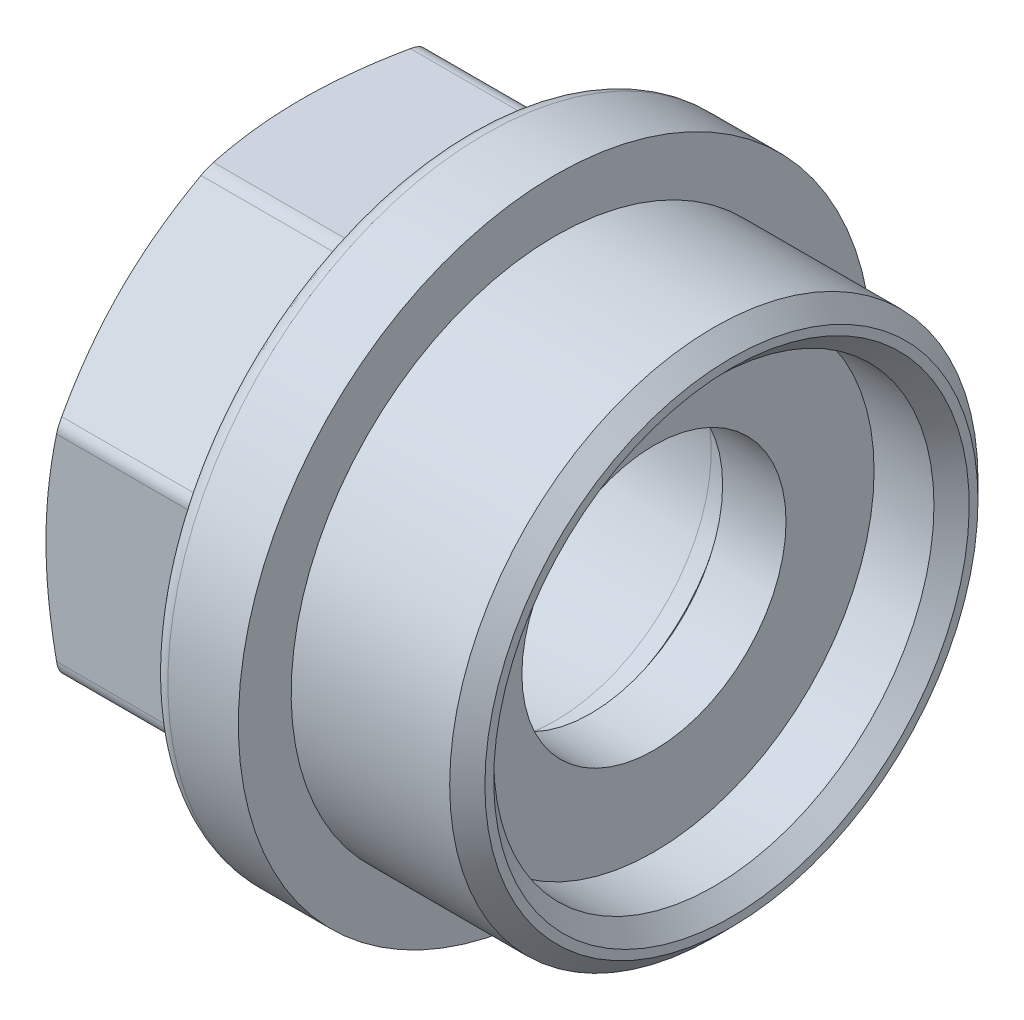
ISO-10303-21;
HEADER;
FILE_DESCRIPTION(('STEP AP214'),'2;1');
FILE_NAME('part.step','',(''),(''),'','','');
FILE_SCHEMA(('AUTOMOTIVE_DESIGN { 1 0 10303 214 1 1 1 1 }'));
ENDSEC;
DATA;
#1=APPLICATION_CONTEXT('core data for automotive mechanical design processes');
#2=APPLICATION_PROTOCOL_DEFINITION('international standard','automotive_design',2000,#1);
#3=PRODUCT_CONTEXT('',#1,'mechanical');
#4=PRODUCT('Part','Part','',(#3));
#5=PRODUCT_RELATED_PRODUCT_CATEGORY('part','',(#4));
#6=PRODUCT_DEFINITION_FORMATION('','',#4);
#7=PRODUCT_DEFINITION_CONTEXT('part definition',#1,'design');
#8=PRODUCT_DEFINITION('design','',#6,#7);
#9=PRODUCT_DEFINITION_SHAPE('','',#8);
#10=(LENGTH_UNIT() NAMED_UNIT(*) SI_UNIT(.MILLI.,.METRE.));
#11=(NAMED_UNIT(*) PLANE_ANGLE_UNIT() SI_UNIT($,.RADIAN.));
#12=(NAMED_UNIT(*) SI_UNIT($,.STERADIAN.) SOLID_ANGLE_UNIT());
#13=UNCERTAINTY_MEASURE_WITH_UNIT(LENGTH_MEASURE(1.E-05),#10,'distance_accuracy_value','');
#14=(GEOMETRIC_REPRESENTATION_CONTEXT(3) GLOBAL_UNCERTAINTY_ASSIGNED_CONTEXT((#13)) GLOBAL_UNIT_ASSIGNED_CONTEXT((#10,
#11,#12)) REPRESENTATION_CONTEXT('',''));
#15=CARTESIAN_POINT('',(0.,0.,0.));
#16=DIRECTION('',(0.,0.,1.));
#17=DIRECTION('',(1.,0.,0.));
#18=AXIS2_PLACEMENT_3D('',#15,#16,#17);
#19=CARTESIAN_POINT('',(-25.0000000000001,0.,0.));
#20=DIRECTION('',(-1.,0.,0.));
#21=DIRECTION('',(0.,-1.,0.));
#22=AXIS2_PLACEMENT_3D('',#19,#20,#21);
#23=CONICAL_SURFACE('',#22,10.8499999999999,0.785398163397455);
#24=CARTESIAN_POINT('',(-23.9285714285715,0.,0.));
#25=DIRECTION('',(-1.,0.,0.));
#26=DIRECTION('',(0.,-1.,0.));
#27=AXIS2_PLACEMENT_3D('',#24,#25,#26);
#28=CIRCLE('',#27,9.77857142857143);
#29=CARTESIAN_POINT('',(-23.9285714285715,-9.77857142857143,0.));
#30=VERTEX_POINT('',#29);
#31=EDGE_CURVE('E253',#30,#30,#28,.F.);
#32=ORIENTED_EDGE('',*,*,#31,.T.);
#33=EDGE_LOOP('',(#32));
#34=FACE_BOUND('',#33,.T.);
#35=CARTESIAN_POINT('',(-25.0000000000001,0.,0.));
#36=DIRECTION('',(-1.,0.,0.));
#37=DIRECTION('',(0.,-1.,0.));
#38=AXIS2_PLACEMENT_3D('',#35,#36,#37);
#39=CIRCLE('',#38,10.8499999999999);
#40=CARTESIAN_POINT('',(-25.0000000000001,-10.8499999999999,0.));
#41=VERTEX_POINT('',#40);
#42=EDGE_CURVE('E20',#41,#41,#39,.T.);
#43=ORIENTED_EDGE('',*,*,#42,.T.);
#44=EDGE_LOOP('',(#43));
#45=FACE_BOUND('',#44,.T.);
#46=ADVANCED_FACE('F17',(#34,#45),#23,.F.);
#47=CARTESIAN_POINT('',(-23.9285714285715,0.,0.));
#48=DIRECTION('',(-1.,0.,0.));
#49=DIRECTION('',(0.,-1.,0.));
#50=AXIS2_PLACEMENT_3D('',#47,#48,#49);
#51=CONICAL_SURFACE('',#50,9.77857142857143,0.0665681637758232);
#52=CARTESIAN_POINT('',(-10.,0.,0.));
#53=DIRECTION('',(1.,0.,0.));
#54=DIRECTION('',(0.,1.,0.));
#55=AXIS2_PLACEMENT_3D('',#52,#53,#54);
#56=CIRCLE('',#55,8.85);
#57=CARTESIAN_POINT('',(-10.,8.85000000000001,0.));
#58=VERTEX_POINT('',#57);
#59=EDGE_CURVE('E246',#58,#58,#56,.T.);
#60=ORIENTED_EDGE('',*,*,#59,.T.);
#61=EDGE_LOOP('',(#60));
#62=FACE_BOUND('',#61,.T.);
#63=ORIENTED_EDGE('',*,*,#31,.F.);
#64=EDGE_LOOP('',(#63));
#65=FACE_BOUND('',#64,.T.);
#66=ADVANCED_FACE('F418',(#62,#65),#51,.F.);
#67=CARTESIAN_POINT('',(-25.,14.5,0.));
#68=DIRECTION('',(1.,0.,0.));
#69=DIRECTION('',(0.,0.,-1.));
#70=AXIS2_PLACEMENT_3D('',#67,#68,#69);
#71=PLANE('',#70);
#72=ORIENTED_EDGE('',*,*,#42,.F.);
#73=EDGE_LOOP('',(#72));
#74=FACE_BOUND('',#73,.T.);
#75=CARTESIAN_POINT('',(-25.,0.,0.));
#76=DIRECTION('',(1.,0.,0.));
#77=DIRECTION('',(0.,0.,-1.));
#78=AXIS2_PLACEMENT_3D('',#75,#76,#77);
#79=CIRCLE('',#78,13.5);
#80=CARTESIAN_POINT('',(-25.,0.,-13.5));
#81=VERTEX_POINT('',#80);
#82=EDGE_CURVE('E956',#81,#81,#79,.T.);
#83=ORIENTED_EDGE('',*,*,#82,.F.);
#84=EDGE_LOOP('',(#83));
#85=FACE_BOUND('',#84,.T.);
#86=ADVANCED_FACE('F415',(#74,#85),#71,.F.);
#87=CARTESIAN_POINT('',(-29.,0.,0.));
#88=DIRECTION('',(1.,0.,0.));
#89=DIRECTION('',(0.,1.,0.));
#90=AXIS2_PLACEMENT_3D('',#87,#88,#89);
#91=CYLINDRICAL_SURFACE('',#90,8.85);
#92=CARTESIAN_POINT('',(-9.,0.,0.));
#93=DIRECTION('',(-1.,0.,0.));
#94=DIRECTION('',(0.,-1.,0.));
#95=AXIS2_PLACEMENT_3D('',#92,#93,#94);
#96=CIRCLE('',#95,8.85);
#97=CARTESIAN_POINT('',(-9.,-8.84999999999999,0.));
#98=VERTEX_POINT('',#97);
#99=EDGE_CURVE('E204',#98,#98,#96,.F.);
#100=ORIENTED_EDGE('',*,*,#99,.T.);
#101=EDGE_LOOP('',(#100));
#102=FACE_BOUND('',#101,.T.);
#103=ORIENTED_EDGE('',*,*,#59,.F.);
#104=EDGE_LOOP('',(#103));
#105=FACE_BOUND('',#104,.T.);
#106=ADVANCED_FACE('F409',(#102,#105),#91,.F.);
#107=CARTESIAN_POINT('',(26.0121933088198,-5.59188309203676,-13.5));
#108=DIRECTION('',(1.,0.,0.));
#109=DIRECTION('',(0.,0.,-1.));
#110=AXIS2_PLACEMENT_3D('',#107,#108,#109);
#111=CYLINDRICAL_SURFACE('',#110,1.);
#112=DIRECTION('',(-1.,0.,0.));
#113=VECTOR('',#112,1.);
#114=CARTESIAN_POINT('',(26.0121933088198,-5.59188309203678,-14.5));
#115=LINE('',#114,#113);
#116=CARTESIAN_POINT('',(-16.,-5.59188309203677,-14.5));
#117=VERTEX_POINT('',#116);
#118=CARTESIAN_POINT('',(-23.8216935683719,-5.59188309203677,-14.5));
#119=VERTEX_POINT('',#118);
#120=EDGE_CURVE('E181',#117,#119,#115,.T.);
#121=ORIENTED_EDGE('',*,*,#120,.F.);
#122=CARTESIAN_POINT('',(-16.,-5.59188309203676,-13.5));
#123=DIRECTION('',(1.,0.,0.));
#124=DIRECTION('',(0.,0.,-1.));
#125=AXIS2_PLACEMENT_3D('',#122,#123,#124);
#126=CIRCLE('',#125,1.);
#127=CARTESIAN_POINT('',(-16.,-6.29898987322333,-14.2071067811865));
#128=VERTEX_POINT('',#127);
#129=EDGE_CURVE('E242',#117,#128,#126,.F.);
#130=ORIENTED_EDGE('',*,*,#129,.T.);
#131=DIRECTION('',(1.,0.,0.));
#132=VECTOR('',#131,1.);
#133=CARTESIAN_POINT('',(26.0121933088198,-6.29898987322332,-14.2071067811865));
#134=LINE('',#133,#132);
#135=CARTESIAN_POINT('',(-23.8216935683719,-6.29898987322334,-14.2071067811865));
#136=VERTEX_POINT('',#135);
#137=EDGE_CURVE('E184',#136,#128,#134,.T.);
#138=ORIENTED_EDGE('',*,*,#137,.F.);
#139=CARTESIAN_POINT('',(-23.8216935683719,-5.59188309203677,-14.5));
#140=CARTESIAN_POINT('',(-23.8165786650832,-5.61650418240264,-14.5000003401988));
#141=CARTESIAN_POINT('',(-23.8119075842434,-5.64120809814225,-14.4990898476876));
#142=CARTESIAN_POINT('',(-23.8034916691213,-5.69064154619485,-14.4954204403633));
#143=CARTESIAN_POINT('',(-23.7997470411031,-5.71537108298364,-14.4926611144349));
#144=CARTESIAN_POINT('',(-23.7899753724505,-5.78928463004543,-14.4815833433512));
#145=CARTESIAN_POINT('',(-23.7853922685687,-5.83828127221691,-14.4704652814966));
#146=CARTESIAN_POINT('',(-23.7802971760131,-5.93431338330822,-14.4408905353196));
#147=CARTESIAN_POINT('',(-23.779793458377,-5.9813446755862,-14.4224190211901));
#148=CARTESIAN_POINT('',(-23.7828988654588,-6.07195341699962,-14.3786679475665));
#149=CARTESIAN_POINT('',(-23.7865043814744,-6.11553386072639,-14.3533943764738));
#150=CARTESIAN_POINT('',(-23.7955425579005,-6.18242825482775,-14.307605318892));
#151=CARTESIAN_POINT('',(-23.7997697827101,-6.20717709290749,-14.2889012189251));
#152=CARTESIAN_POINT('',(-23.8096679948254,-6.25464395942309,-14.2494666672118));
#153=CARTESIAN_POINT('',(-23.8153373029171,-6.27736430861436,-14.2287385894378));
#154=CARTESIAN_POINT('',(-23.8216935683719,-6.29898987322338,-14.2071067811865));
#155=B_SPLINE_CURVE_WITH_KNOTS('',3,(#139,#140,#141,#142,#143,#144,#145,#146,#147,#148,#149,
#150,#151,#152,#153,#154),.UNSPECIFIED.,.F.,.F.,(4,2,2,2,2,2,2,4),(0.,0.0753997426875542,
0.150816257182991,0.301383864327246,0.452256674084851,0.602997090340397,0.696770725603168,
0.790435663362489),.UNSPECIFIED.);
#156=EDGE_CURVE('E177',#119,#136,#155,.T.);
#157=ORIENTED_EDGE('',*,*,#156,.F.);
#158=EDGE_LOOP('',(#121,#130,#138,#157));
#159=FACE_BOUND('',#158,.T.);
#160=ADVANCED_FACE('F179',(#159),#111,.T.);
#161=CARTESIAN_POINT('',(26.0121933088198,-13.5,-5.59188309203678));
#162=DIRECTION('',(1.,0.,0.));
#163=DIRECTION('',(0.,0.,-1.));
#164=AXIS2_PLACEMENT_3D('',#161,#162,#163);
#165=CYLINDRICAL_SURFACE('',#164,1.);
#166=DIRECTION('',(1.,0.,0.));
#167=VECTOR('',#166,1.);
#168=CARTESIAN_POINT('',(26.0121933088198,-14.2071067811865,-6.29898987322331));
#169=LINE('',#168,#167);
#170=CARTESIAN_POINT('',(-16.,-14.2071067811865,-6.29898987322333));
#171=VERTEX_POINT('',#170);
#172=CARTESIAN_POINT('',(-23.8216935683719,-14.2071067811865,-6.29898987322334));
#173=VERTEX_POINT('',#172);
#174=EDGE_CURVE('E910',#171,#173,#169,.F.);
#175=ORIENTED_EDGE('',*,*,#174,.F.);
#176=CARTESIAN_POINT('',(-16.,-13.5,-5.59188309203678));
#177=DIRECTION('',(1.,0.,0.));
#178=DIRECTION('',(0.,0.,-1.));
#179=AXIS2_PLACEMENT_3D('',#176,#177,#178);
#180=CIRCLE('',#179,1.);
#181=CARTESIAN_POINT('',(-16.,-14.5,-5.59188309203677));
#182=VERTEX_POINT('',#181);
#183=EDGE_CURVE('E238',#171,#182,#180,.F.);
#184=ORIENTED_EDGE('',*,*,#183,.T.);
#185=DIRECTION('',(1.,0.,0.));
#186=VECTOR('',#185,1.);
#187=CARTESIAN_POINT('',(26.0121933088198,-14.5,-5.59188309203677));
#188=LINE('',#187,#186);
#189=CARTESIAN_POINT('',(-23.8216935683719,-14.5,-5.59188309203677));
#190=VERTEX_POINT('',#189);
#191=EDGE_CURVE('E887',#190,#182,#188,.T.);
#192=ORIENTED_EDGE('',*,*,#191,.F.);
#193=CARTESIAN_POINT('',(-23.8216935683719,-14.2071067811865,-6.29898987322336));
#194=CARTESIAN_POINT('',(-23.8165786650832,-14.2245167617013,-6.2815803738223));
#195=CARTESIAN_POINT('',(-23.8119075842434,-14.2413412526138,-6.26346825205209));
#196=CARTESIAN_POINT('',(-23.8034916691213,-14.2737013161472,-6.22591886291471));
#197=CARTESIAN_POINT('',(-23.7997470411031,-14.2892366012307,-6.20648130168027));
#198=CARTESIAN_POINT('',(-23.7899753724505,-14.3336682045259,-6.14638336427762));
#199=CARTESIAN_POINT('',(-23.7853922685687,-14.3604524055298,-6.10387584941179));
#200=CARTESIAN_POINT('',(-23.7802971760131,-14.4074448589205,-6.01505838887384));
#201=CARTESIAN_POINT('',(-23.779793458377,-14.4276396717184,-5.96874091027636));
#202=CARTESIAN_POINT('',(-23.7828988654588,-14.4607730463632,-5.87373417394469));
#203=CARTESIAN_POINT('',(-23.7865043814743,-14.4737179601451,-5.82504703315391));
#204=CARTESIAN_POINT('',(-23.7955425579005,-14.4886416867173,-5.74536780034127));
#205=CARTESIAN_POINT('',(-23.7997697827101,-14.4929159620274,-5.71464193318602));
#206=CARTESIAN_POINT('',(-23.8096679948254,-14.4985956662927,-5.65319335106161));
#207=CARTESIAN_POINT('',(-23.8153373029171,-14.5000044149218,-5.62247067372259));
#208=CARTESIAN_POINT('',(-23.8216935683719,-14.5,-5.59188309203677));
#209=B_SPLINE_CURVE_WITH_KNOTS('',3,(#193,#194,#195,#196,#197,#198,#199,#200,#201,#202,#203,
#204,#205,#206,#207,#208),.UNSPECIFIED.,.F.,.F.,(4,2,2,2,2,2,2,4),(0.,0.0753997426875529,
0.150816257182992,0.301383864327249,0.452256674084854,0.602997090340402,0.696770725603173,
0.790435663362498),.UNSPECIFIED.);
#210=EDGE_CURVE('E188',#173,#190,#209,.T.);
#211=ORIENTED_EDGE('',*,*,#210,.F.);
#212=EDGE_LOOP('',(#175,#184,#192,#211));
#213=FACE_BOUND('',#212,.T.);
#214=ADVANCED_FACE('F399',(#213),#165,.T.);
#215=CARTESIAN_POINT('',(26.0121933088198,-13.5,5.59188309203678));
#216=DIRECTION('',(1.,0.,0.));
#217=DIRECTION('',(0.,0.,-1.));
#218=AXIS2_PLACEMENT_3D('',#215,#216,#217);
#219=CYLINDRICAL_SURFACE('',#218,1.);
#220=DIRECTION('',(1.,0.,0.));
#221=VECTOR('',#220,1.);
#222=CARTESIAN_POINT('',(26.0121933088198,-14.5,5.59188309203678));
#223=LINE('',#222,#221);
#224=CARTESIAN_POINT('',(-16.,-14.5,5.59188309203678));
#225=VERTEX_POINT('',#224);
#226=CARTESIAN_POINT('',(-23.8216935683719,-14.5,5.59188309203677));
#227=VERTEX_POINT('',#226);
#228=EDGE_CURVE('E898',#225,#227,#223,.F.);
#229=ORIENTED_EDGE('',*,*,#228,.F.);
#230=CARTESIAN_POINT('',(-16.,-13.5,5.59188309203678));
#231=DIRECTION('',(1.,0.,0.));
#232=DIRECTION('',(0.,0.,-1.));
#233=AXIS2_PLACEMENT_3D('',#230,#231,#232);
#234=CIRCLE('',#233,1.);
#235=CARTESIAN_POINT('',(-16.,-14.2071067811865,6.29898987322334));
#236=VERTEX_POINT('',#235);
#237=EDGE_CURVE('E234',#225,#236,#234,.F.);
#238=ORIENTED_EDGE('',*,*,#237,.T.);
#239=DIRECTION('',(1.,0.,0.));
#240=VECTOR('',#239,1.);
#241=CARTESIAN_POINT('',(26.0121933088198,-14.2071067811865,6.29898987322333));
#242=LINE('',#241,#240);
#243=CARTESIAN_POINT('',(-23.8216935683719,-14.2071067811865,6.29898987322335));
#244=VERTEX_POINT('',#243);
#245=EDGE_CURVE('E873',#244,#236,#242,.T.);
#246=ORIENTED_EDGE('',*,*,#245,.F.);
#247=CARTESIAN_POINT('',(-23.8216935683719,-14.5,5.59188309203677));
#248=CARTESIAN_POINT('',(-23.8165786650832,-14.5000003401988,5.61650418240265));
#249=CARTESIAN_POINT('',(-23.8119075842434,-14.4990898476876,5.64120809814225));
#250=CARTESIAN_POINT('',(-23.8034916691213,-14.4954204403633,5.69064154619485));
#251=CARTESIAN_POINT('',(-23.7997470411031,-14.4926611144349,5.71537108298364));
#252=CARTESIAN_POINT('',(-23.7899753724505,-14.4815833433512,5.78928463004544));
#253=CARTESIAN_POINT('',(-23.7853922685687,-14.4704652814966,5.83828127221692));
#254=CARTESIAN_POINT('',(-23.7802971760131,-14.4408905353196,5.93431338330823));
#255=CARTESIAN_POINT('',(-23.779793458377,-14.4224190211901,5.98134467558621));
#256=CARTESIAN_POINT('',(-23.7828988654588,-14.3786679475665,6.07195341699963));
#257=CARTESIAN_POINT('',(-23.7865043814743,-14.3533943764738,6.1155338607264));
#258=CARTESIAN_POINT('',(-23.7955425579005,-14.307605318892,6.18242825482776));
#259=CARTESIAN_POINT('',(-23.7997697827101,-14.2889012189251,6.2071770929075));
#260=CARTESIAN_POINT('',(-23.8096679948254,-14.2494666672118,6.2546439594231));
#261=CARTESIAN_POINT('',(-23.8153373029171,-14.2287385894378,6.27736430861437));
#262=CARTESIAN_POINT('',(-23.8216935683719,-14.2071067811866,6.29898987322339));
#263=B_SPLINE_CURVE_WITH_KNOTS('',3,(#247,#248,#249,#250,#251,#252,#253,#254,#255,#256,#257,
#258,#259,#260,#261,#262),.UNSPECIFIED.,.F.,.F.,(4,2,2,2,2,2,2,4),(0.,0.0753997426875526,
0.150816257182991,0.301383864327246,0.45225667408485,0.602997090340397,0.696770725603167,
0.790435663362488),.UNSPECIFIED.);
#264=EDGE_CURVE('E390',#227,#244,#263,.T.);
#265=ORIENTED_EDGE('',*,*,#264,.F.);
#266=EDGE_LOOP('',(#229,#238,#246,#265));
#267=FACE_BOUND('',#266,.T.);
#268=ADVANCED_FACE('F395',(#267),#219,.T.);
#269=CARTESIAN_POINT('',(26.0121933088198,-5.59188309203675,13.5));
#270=DIRECTION('',(1.,0.,0.));
#271=DIRECTION('',(0.,0.,-1.));
#272=AXIS2_PLACEMENT_3D('',#269,#270,#271);
#273=CYLINDRICAL_SURFACE('',#272,1.);
#274=DIRECTION('',(1.,0.,0.));
#275=VECTOR('',#274,1.);
#276=CARTESIAN_POINT('',(26.0121933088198,-6.29898987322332,14.2071067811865));
#277=LINE('',#276,#275);
#278=CARTESIAN_POINT('',(-16.,-6.29898987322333,14.2071067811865));
#279=VERTEX_POINT('',#278);
#280=CARTESIAN_POINT('',(-23.8216935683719,-6.29898987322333,14.2071067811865));
#281=VERTEX_POINT('',#280);
#282=EDGE_CURVE('E884',#279,#281,#277,.F.);
#283=ORIENTED_EDGE('',*,*,#282,.F.);
#284=CARTESIAN_POINT('',(-16.,-5.59188309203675,13.5));
#285=DIRECTION('',(1.,0.,0.));
#286=DIRECTION('',(0.,0.,-1.));
#287=AXIS2_PLACEMENT_3D('',#284,#285,#286);
#288=CIRCLE('',#287,1.);
#289=CARTESIAN_POINT('',(-16.,-5.59188309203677,14.5));
#290=VERTEX_POINT('',#289);
#291=EDGE_CURVE('E230',#279,#290,#288,.F.);
#292=ORIENTED_EDGE('',*,*,#291,.T.);
#293=DIRECTION('',(1.,0.,0.));
#294=VECTOR('',#293,1.);
#295=CARTESIAN_POINT('',(26.0121933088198,-5.59188309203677,14.5));
#296=LINE('',#295,#294);
#297=CARTESIAN_POINT('',(-23.8216935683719,-5.59188309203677,14.5));
#298=VERTEX_POINT('',#297);
#299=EDGE_CURVE('E859',#298,#290,#296,.T.);
#300=ORIENTED_EDGE('',*,*,#299,.F.);
#301=CARTESIAN_POINT('',(-23.8216935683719,-6.29898987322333,14.2071067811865));
#302=CARTESIAN_POINT('',(-23.8165786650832,-6.28158037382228,14.2245167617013));
#303=CARTESIAN_POINT('',(-23.8119075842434,-6.26346825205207,14.2413412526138));
#304=CARTESIAN_POINT('',(-23.8034916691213,-6.22591886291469,14.2737013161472));
#305=CARTESIAN_POINT('',(-23.7997470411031,-6.20648130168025,14.2892366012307));
#306=CARTESIAN_POINT('',(-23.7899753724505,-6.1463833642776,14.3336682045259));
#307=CARTESIAN_POINT('',(-23.7853922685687,-6.10387584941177,14.3604524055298));
#308=CARTESIAN_POINT('',(-23.7802971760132,-6.01505838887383,14.4074448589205));
#309=CARTESIAN_POINT('',(-23.779793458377,-5.96874091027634,14.4276396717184));
#310=CARTESIAN_POINT('',(-23.7828988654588,-5.87373417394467,14.4607730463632));
#311=CARTESIAN_POINT('',(-23.7865043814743,-5.82504703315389,14.473717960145));
#312=CARTESIAN_POINT('',(-23.7955425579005,-5.74536780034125,14.4886416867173));
#313=CARTESIAN_POINT('',(-23.7997697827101,-5.71464193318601,14.4929159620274));
#314=CARTESIAN_POINT('',(-23.8096679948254,-5.6531933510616,14.4985956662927));
#315=CARTESIAN_POINT('',(-23.8153373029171,-5.62247067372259,14.5000044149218));
#316=CARTESIAN_POINT('',(-23.8216935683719,-5.59188309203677,14.5));
#317=B_SPLINE_CURVE_WITH_KNOTS('',3,(#301,#302,#303,#304,#305,#306,#307,#308,#309,#310,#311,
#312,#313,#314,#315,#316),.UNSPECIFIED.,.F.,.F.,(4,2,2,2,2,2,2,4),(0.,0.0753997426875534,
0.150816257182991,0.301383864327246,0.45225667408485,0.602997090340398,0.696770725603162,
0.79043566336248),.UNSPECIFIED.);
#318=EDGE_CURVE('E385',#281,#298,#317,.T.);
#319=ORIENTED_EDGE('',*,*,#318,.F.);
#320=EDGE_LOOP('',(#283,#292,#300,#319));
#321=FACE_BOUND('',#320,.T.);
#322=ADVANCED_FACE('F398',(#321),#273,.T.);
#323=CARTESIAN_POINT('',(26.0121933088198,5.59188309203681,13.5));
#324=DIRECTION('',(1.,0.,0.));
#325=DIRECTION('',(0.,0.,-1.));
#326=AXIS2_PLACEMENT_3D('',#323,#324,#325);
#327=CYLINDRICAL_SURFACE('',#326,1.);
#328=DIRECTION('',(1.,0.,0.));
#329=VECTOR('',#328,1.);
#330=CARTESIAN_POINT('',(26.0121933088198,5.59188309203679,14.5));
#331=LINE('',#330,#329);
#332=CARTESIAN_POINT('',(-16.,5.59188309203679,14.5));
#333=VERTEX_POINT('',#332);
#334=CARTESIAN_POINT('',(-23.8216935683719,5.59188309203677,14.5));
#335=VERTEX_POINT('',#334);
#336=EDGE_CURVE('E870',#333,#335,#331,.F.);
#337=ORIENTED_EDGE('',*,*,#336,.F.);
#338=CARTESIAN_POINT('',(-16.,5.59188309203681,13.5));
#339=DIRECTION('',(1.,0.,0.));
#340=DIRECTION('',(0.,0.,-1.));
#341=AXIS2_PLACEMENT_3D('',#338,#339,#340);
#342=CIRCLE('',#341,1.);
#343=CARTESIAN_POINT('',(-16.,6.29898987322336,14.2071067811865));
#344=VERTEX_POINT('',#343);
#345=EDGE_CURVE('E226',#333,#344,#342,.F.);
#346=ORIENTED_EDGE('',*,*,#345,.T.);
#347=DIRECTION('',(1.,0.,0.));
#348=VECTOR('',#347,1.);
#349=CARTESIAN_POINT('',(26.0121933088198,6.29898987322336,14.2071067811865));
#350=LINE('',#349,#348);
#351=CARTESIAN_POINT('',(-23.8216935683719,6.29898987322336,14.2071067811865));
#352=VERTEX_POINT('',#351);
#353=EDGE_CURVE('E845',#352,#344,#350,.T.);
#354=ORIENTED_EDGE('',*,*,#353,.F.);
#355=CARTESIAN_POINT('',(-23.8216935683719,5.59188309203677,14.5));
#356=CARTESIAN_POINT('',(-23.8165786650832,5.61650418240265,14.5000003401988));
#357=CARTESIAN_POINT('',(-23.8119075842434,5.64120809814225,14.4990898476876));
#358=CARTESIAN_POINT('',(-23.8034916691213,5.69064154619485,14.4954204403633));
#359=CARTESIAN_POINT('',(-23.7997470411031,5.71537108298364,14.4926611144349));
#360=CARTESIAN_POINT('',(-23.7899753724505,5.78928463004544,14.4815833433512));
#361=CARTESIAN_POINT('',(-23.7853922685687,5.83828127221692,14.4704652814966));
#362=CARTESIAN_POINT('',(-23.7802971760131,5.93431338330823,14.4408905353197));
#363=CARTESIAN_POINT('',(-23.779793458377,5.98134467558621,14.4224190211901));
#364=CARTESIAN_POINT('',(-23.7828988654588,6.07195341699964,14.3786679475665));
#365=CARTESIAN_POINT('',(-23.7865043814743,6.11553386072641,14.3533943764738));
#366=CARTESIAN_POINT('',(-23.7955425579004,6.18242825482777,14.307605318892));
#367=CARTESIAN_POINT('',(-23.7997697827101,6.20717709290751,14.2889012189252));
#368=CARTESIAN_POINT('',(-23.8096679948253,6.25464395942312,14.2494666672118));
#369=CARTESIAN_POINT('',(-23.8153373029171,6.2773643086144,14.2287385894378));
#370=CARTESIAN_POINT('',(-23.8216935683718,6.29898987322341,14.2071067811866));
#371=B_SPLINE_CURVE_WITH_KNOTS('',3,(#355,#356,#357,#358,#359,#360,#361,#362,#363,#364,#365,
#366,#367,#368,#369,#370),.UNSPECIFIED.,.F.,.F.,(4,2,2,2,2,2,2,4),(0.,0.0753997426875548,
0.150816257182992,0.301383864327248,0.452256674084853,0.6029970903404,0.696770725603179,
0.79043566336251),.UNSPECIFIED.);
#372=EDGE_CURVE('E379',#335,#352,#371,.T.);
#373=ORIENTED_EDGE('',*,*,#372,.F.);
#374=EDGE_LOOP('',(#337,#346,#354,#373));
#375=FACE_BOUND('',#374,.T.);
#376=ADVANCED_FACE('F978',(#375),#327,.T.);
#377=CARTESIAN_POINT('',(26.0121933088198,13.5,5.59188309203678));
#378=DIRECTION('',(1.,0.,0.));
#379=DIRECTION('',(0.,0.,-1.));
#380=AXIS2_PLACEMENT_3D('',#377,#378,#379);
#381=CYLINDRICAL_SURFACE('',#380,1.);
#382=DIRECTION('',(1.,0.,0.));
#383=VECTOR('',#382,1.);
#384=CARTESIAN_POINT('',(26.0121933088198,14.2071067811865,6.29898987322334));
#385=LINE('',#384,#383);
#386=CARTESIAN_POINT('',(-16.,14.2071067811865,6.29898987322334));
#387=VERTEX_POINT('',#386);
#388=CARTESIAN_POINT('',(-23.8216935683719,14.2071067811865,6.29898987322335));
#389=VERTEX_POINT('',#388);
#390=EDGE_CURVE('E856',#387,#389,#385,.F.);
#391=ORIENTED_EDGE('',*,*,#390,.F.);
#392=CARTESIAN_POINT('',(-16.,13.5,5.59188309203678));
#393=DIRECTION('',(1.,0.,0.));
#394=DIRECTION('',(0.,0.,-1.));
#395=AXIS2_PLACEMENT_3D('',#392,#393,#394);
#396=CIRCLE('',#395,1.);
#397=CARTESIAN_POINT('',(-16.,14.5,5.59188309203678));
#398=VERTEX_POINT('',#397);
#399=EDGE_CURVE('E222',#387,#398,#396,.F.);
#400=ORIENTED_EDGE('',*,*,#399,.T.);
#401=DIRECTION('',(1.,0.,0.));
#402=VECTOR('',#401,1.);
#403=CARTESIAN_POINT('',(26.0121933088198,14.5,5.59188309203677));
#404=LINE('',#403,#402);
#405=CARTESIAN_POINT('',(-23.8216935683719,14.5,5.59188309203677));
#406=VERTEX_POINT('',#405);
#407=EDGE_CURVE('E831',#406,#398,#404,.T.);
#408=ORIENTED_EDGE('',*,*,#407,.F.);
#409=CARTESIAN_POINT('',(-23.8216935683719,14.2071067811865,6.29898987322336));
#410=CARTESIAN_POINT('',(-23.8165786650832,14.2245167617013,6.28158037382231));
#411=CARTESIAN_POINT('',(-23.8119075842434,14.2413412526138,6.2634682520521));
#412=CARTESIAN_POINT('',(-23.8034916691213,14.2737013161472,6.22591886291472));
#413=CARTESIAN_POINT('',(-23.7997470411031,14.2892366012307,6.20648130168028));
#414=CARTESIAN_POINT('',(-23.7899753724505,14.3336682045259,6.14638336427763));
#415=CARTESIAN_POINT('',(-23.7853922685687,14.3604524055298,6.10387584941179));
#416=CARTESIAN_POINT('',(-23.7802971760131,14.4074448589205,6.01505838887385));
#417=CARTESIAN_POINT('',(-23.779793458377,14.4276396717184,5.96874091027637));
#418=CARTESIAN_POINT('',(-23.7828988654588,14.4607730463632,5.8737341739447));
#419=CARTESIAN_POINT('',(-23.7865043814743,14.473717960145,5.82504703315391));
#420=CARTESIAN_POINT('',(-23.7955425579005,14.4886416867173,5.74536780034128));
#421=CARTESIAN_POINT('',(-23.7997697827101,14.4929159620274,5.71464193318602));
#422=CARTESIAN_POINT('',(-23.8096679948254,14.4985956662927,5.65319335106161));
#423=CARTESIAN_POINT('',(-23.8153373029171,14.5000044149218,5.6224706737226));
#424=CARTESIAN_POINT('',(-23.8216935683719,14.5,5.59188309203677));
#425=B_SPLINE_CURVE_WITH_KNOTS('',3,(#409,#410,#411,#412,#413,#414,#415,#416,#417,#418,#419,
#420,#421,#422,#423,#424),.UNSPECIFIED.,.F.,.F.,(4,2,2,2,2,2,2,4),(0.,0.075399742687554,
0.150816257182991,0.301383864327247,0.452256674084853,0.602997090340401,0.696770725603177,
0.790435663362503),.UNSPECIFIED.);
#426=EDGE_CURVE('E373',#389,#406,#425,.T.);
#427=ORIENTED_EDGE('',*,*,#426,.F.);
#428=EDGE_LOOP('',(#391,#400,#408,#427));
#429=FACE_BOUND('',#428,.T.);
#430=ADVANCED_FACE('F974',(#429),#381,.T.);
#431=CARTESIAN_POINT('',(26.0121933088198,5.5918830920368,-13.5));
#432=DIRECTION('',(1.,0.,0.));
#433=DIRECTION('',(0.,0.,-1.));
#434=AXIS2_PLACEMENT_3D('',#431,#432,#433);
#435=CYLINDRICAL_SURFACE('',#434,1.);
#436=DIRECTION('',(1.,0.,0.));
#437=VECTOR('',#436,1.);
#438=CARTESIAN_POINT('',(26.0121933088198,6.29898987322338,-14.2071067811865));
#439=LINE('',#438,#437);
#440=CARTESIAN_POINT('',(-16.,6.29898987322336,-14.2071067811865));
#441=VERTEX_POINT('',#440);
#442=CARTESIAN_POINT('',(-23.8216935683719,6.29898987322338,-14.2071067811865));
#443=VERTEX_POINT('',#442);
#444=EDGE_CURVE('E289',#441,#443,#439,.F.);
#445=ORIENTED_EDGE('',*,*,#444,.F.);
#446=CARTESIAN_POINT('',(-16.,5.5918830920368,-13.5));
#447=DIRECTION('',(1.,0.,0.));
#448=DIRECTION('',(0.,0.,-1.));
#449=AXIS2_PLACEMENT_3D('',#446,#447,#448);
#450=CIRCLE('',#449,1.);
#451=CARTESIAN_POINT('',(-16.,5.59188309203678,-14.5));
#452=VERTEX_POINT('',#451);
#453=EDGE_CURVE('E189',#441,#452,#450,.F.);
#454=ORIENTED_EDGE('',*,*,#453,.T.);
#455=DIRECTION('',(-1.,0.,0.));
#456=VECTOR('',#455,1.);
#457=CARTESIAN_POINT('',(26.0121933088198,5.59188309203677,-14.5));
#458=LINE('',#457,#456);
#459=CARTESIAN_POINT('',(-23.8216935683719,5.59188309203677,-14.5));
#460=VERTEX_POINT('',#459);
#461=EDGE_CURVE('E198',#460,#452,#458,.F.);
#462=ORIENTED_EDGE('',*,*,#461,.F.);
#463=CARTESIAN_POINT('',(-23.8216935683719,6.29898987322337,-14.2071067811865));
#464=CARTESIAN_POINT('',(-23.8165786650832,6.28158037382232,-14.2245167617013));
#465=CARTESIAN_POINT('',(-23.8119075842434,6.26346825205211,-14.2413412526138));
#466=CARTESIAN_POINT('',(-23.8034916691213,6.22591886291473,-14.2737013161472));
#467=CARTESIAN_POINT('',(-23.7997470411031,6.20648130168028,-14.2892366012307));
#468=CARTESIAN_POINT('',(-23.7899753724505,6.14638336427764,-14.333668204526));
#469=CARTESIAN_POINT('',(-23.7853922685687,6.1038758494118,-14.3604524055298));
#470=CARTESIAN_POINT('',(-23.7802971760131,6.01505838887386,-14.4074448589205));
#471=CARTESIAN_POINT('',(-23.779793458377,5.96874091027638,-14.4276396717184));
#472=CARTESIAN_POINT('',(-23.7828988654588,5.87373417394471,-14.4607730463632));
#473=CARTESIAN_POINT('',(-23.7865043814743,5.82504703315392,-14.473717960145));
#474=CARTESIAN_POINT('',(-23.7955425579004,5.74536780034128,-14.4886416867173));
#475=CARTESIAN_POINT('',(-23.7997697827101,5.71464193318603,-14.4929159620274));
#476=CARTESIAN_POINT('',(-23.8096679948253,5.65319335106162,-14.4985956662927));
#477=CARTESIAN_POINT('',(-23.8153373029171,5.6224706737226,-14.5000044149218));
#478=CARTESIAN_POINT('',(-23.8216935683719,5.59188309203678,-14.5));
#479=B_SPLINE_CURVE_WITH_KNOTS('',3,(#463,#464,#465,#466,#467,#468,#469,#470,#471,#472,#473,
#474,#475,#476,#477,#478),.UNSPECIFIED.,.F.,.F.,(4,2,2,2,2,2,2,4),(0.,0.0753997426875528,
0.150816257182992,0.301383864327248,0.452256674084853,0.6029970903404,0.696770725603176,
0.790435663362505),.UNSPECIFIED.);
#480=EDGE_CURVE('E194',#443,#460,#479,.T.);
#481=ORIENTED_EDGE('',*,*,#480,.F.);
#482=EDGE_LOOP('',(#445,#454,#462,#481));
#483=FACE_BOUND('',#482,.T.);
#484=ADVANCED_FACE('F304',(#483),#435,.T.);
#485=CARTESIAN_POINT('',(-23.7731352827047,0.,0.));
#486=DIRECTION('',(1.,0.,0.));
#487=DIRECTION('',(0.,0.,-1.));
#488=AXIS2_PLACEMENT_3D('',#485,#486,#487);
#489=CONICAL_SURFACE('',#488,15.6249920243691,1.0471975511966);
#490=ORIENTED_EDGE('',*,*,#82,.T.);
#491=EDGE_LOOP('',(#490));
#492=FACE_BOUND('',#491,.T.);
#493=CARTESIAN_POINT('',(-23.8216935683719,6.29898987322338,-14.2071067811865));
#494=CARTESIAN_POINT('',(-23.8939797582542,6.54496913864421,-13.9611275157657));
#495=CARTESIAN_POINT('',(-23.960610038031,6.79180660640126,-13.7142900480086));
#496=CARTESIAN_POINT('',(-24.0815379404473,7.28704690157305,-13.2190497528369));
#497=CARTESIAN_POINT('',(-24.1358324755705,7.53545010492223,-12.9706465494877));
#498=CARTESIAN_POINT('',(-24.2310570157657,8.03368441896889,-12.472412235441));
#499=CARTESIAN_POINT('',(-24.2719796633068,8.2835162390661,-12.2225804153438));
#500=CARTESIAN_POINT('',(-24.339572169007,8.78412476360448,-11.7219718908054));
#501=CARTESIAN_POINT('',(-24.3662433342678,9.03490137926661,-11.4711952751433));
#502=CARTESIAN_POINT('',(-24.4044290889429,9.53293645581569,-10.9731601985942));
#503=CARTESIAN_POINT('',(-24.4161835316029,9.78018567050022,-10.7259109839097));
#504=CARTESIAN_POINT('',(-24.4250654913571,10.2748278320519,-10.231268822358));
#505=CARTESIAN_POINT('',(-24.422192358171,10.5222207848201,-9.98387586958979));
#506=CARTESIAN_POINT('',(-24.4018894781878,11.0165546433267,-9.4895420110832));
#507=CARTESIAN_POINT('',(-24.3844685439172,11.263495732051,-9.24260092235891));
#508=CARTESIAN_POINT('',(-24.3354688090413,11.7566506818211,-8.74944597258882));
#509=CARTESIAN_POINT('',(-24.3038913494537,12.0028646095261,-8.50323204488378));
#510=CARTESIAN_POINT('',(-24.2400040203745,12.412458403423,-8.09363825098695));
#511=CARTESIAN_POINT('',(-24.211435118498,12.5761364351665,-7.92996021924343));
#512=CARTESIAN_POINT('',(-24.1485504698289,12.9029225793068,-7.6031740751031));
#513=CARTESIAN_POINT('',(-24.1142353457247,13.0660307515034,-7.44006590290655));
#514=CARTESIAN_POINT('',(-24.0399281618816,13.392535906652,-7.11356074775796));
#515=CARTESIAN_POINT('',(-23.9999053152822,13.5559293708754,-6.9501672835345));
#516=CARTESIAN_POINT('',(-23.9146380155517,13.8820393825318,-6.62405727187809));
#517=CARTESIAN_POINT('',(-23.8693934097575,14.0447559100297,-6.46134074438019));
#518=CARTESIAN_POINT('',(-23.8216935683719,14.2071067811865,-6.29898987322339));
#519=B_SPLINE_CURVE_WITH_KNOTS('',3,(#493,#494,#495,#496,#497,#498,#499,#500,#501,#502,#503,
#504,#505,#506,#507,#508,#509,#510,#511,#512,#513,#514,#515,#516,#517,#518),.UNSPECIFIED.,.F.,
.F.,(4,2,2,2,2,2,2,2,2,2,2,2,4),(0.,1.06590403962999,2.13207457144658,3.19883075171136,
4.26548907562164,5.31476928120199,6.36409613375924,7.41278780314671,8.46138015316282,
9.16100899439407,9.86056206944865,10.5640421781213,11.2675428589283),.UNSPECIFIED.);
#520=CARTESIAN_POINT('',(-23.8216935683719,14.2071067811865,-6.29898987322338));
#521=VERTEX_POINT('',#520);
#522=EDGE_CURVE('E280',#443,#521,#519,.T.);
#523=ORIENTED_EDGE('',*,*,#522,.F.);
#524=ORIENTED_EDGE('',*,*,#480,.T.);
#525=CARTESIAN_POINT('',(-23.8216935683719,-5.59188309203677,-14.5));
#526=CARTESIAN_POINT('',(-23.8939797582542,-5.24401587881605,-14.5));
#527=CARTESIAN_POINT('',(-23.960610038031,-4.8949349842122,-14.5));
#528=CARTESIAN_POINT('',(-24.0815379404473,-4.19455944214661,-14.5));
#529=CARTESIAN_POINT('',(-24.1358324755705,-3.84326426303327,-14.5));
#530=CARTESIAN_POINT('',(-24.2310570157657,-3.13865453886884,-14.5));
#531=CARTESIAN_POINT('',(-24.2719796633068,-2.785338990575,-14.5));
#532=CARTESIAN_POINT('',(-24.3395721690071,-2.07737162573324,-14.5));
#533=CARTESIAN_POINT('',(-24.3662433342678,-1.72271993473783,-14.5));
#534=CARTESIAN_POINT('',(-24.4044290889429,-1.01839197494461,-14.5));
#535=CARTESIAN_POINT('',(-24.4161835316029,-0.668728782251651,-14.5));
#536=CARTESIAN_POINT('',(-24.4250654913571,0.0308008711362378,-14.5));
#537=CARTESIAN_POINT('',(-24.422192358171,0.38066734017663,-14.5));
#538=CARTESIAN_POINT('',(-24.4018894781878,1.07976098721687,-14.5));
#539=CARTESIAN_POINT('',(-24.3844685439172,1.42898842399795,-14.5));
#540=CARTESIAN_POINT('',(-24.3354688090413,2.12641484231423,-14.5));
#541=CARTESIAN_POINT('',(-24.3038913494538,2.47461391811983,-14.5));
#542=CARTESIAN_POINT('',(-24.2400040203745,3.05386701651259,-14.5));
#543=CARTESIAN_POINT('',(-24.2114351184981,3.28534270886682,-14.5));
#544=CARTESIAN_POINT('',(-24.1485504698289,3.7474881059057,-14.5));
#545=CARTESIAN_POINT('',(-24.1142353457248,3.97815789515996,-14.5));
#546=CARTESIAN_POINT('',(-24.0399281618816,4.43990591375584,-14.5));
#547=CARTESIAN_POINT('',(-23.9999053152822,4.67097916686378,-14.5));
#548=CARTESIAN_POINT('',(-23.9146380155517,5.13216836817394,-14.5));
#549=CARTESIAN_POINT('',(-23.8693934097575,5.36228428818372,-14.5));
#550=CARTESIAN_POINT('',(-23.8216935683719,5.59188309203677,-14.5));
#551=B_SPLINE_CURVE_WITH_KNOTS('',3,(#525,#526,#527,#528,#529,#530,#531,#532,#533,#534,#535,
#536,#537,#538,#539,#540,#541,#542,#543,#544,#545,#546,#547,#548,#549,#550),.UNSPECIFIED.,.F.,
.F.,(4,2,2,2,2,2,2,2,2,2,2,2,4),(0.,1.06590403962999,2.13207457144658,3.19883075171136,
4.26548907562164,5.31476928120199,6.36409613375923,7.4127878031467,8.46138015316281,
9.16100899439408,9.86056206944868,10.5640421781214,11.2675428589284),.UNSPECIFIED.);
#552=EDGE_CURVE('E191',#119,#460,#551,.T.);
#553=ORIENTED_EDGE('',*,*,#552,.F.);
#554=ORIENTED_EDGE('',*,*,#156,.T.);
#555=CARTESIAN_POINT('',(-23.8216935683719,-14.2071067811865,-6.29898987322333));
#556=CARTESIAN_POINT('',(-23.8939797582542,-13.9611275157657,-6.54496913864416));
#557=CARTESIAN_POINT('',(-23.960610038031,-13.7142900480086,-6.79180660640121));
#558=CARTESIAN_POINT('',(-24.0815379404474,-13.2190497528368,-7.28704690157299));
#559=CARTESIAN_POINT('',(-24.1358324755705,-12.9706465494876,-7.53545010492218));
#560=CARTESIAN_POINT('',(-24.2310570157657,-12.472412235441,-8.03368441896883));
#561=CARTESIAN_POINT('',(-24.2719796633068,-12.2225804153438,-8.28351623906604));
#562=CARTESIAN_POINT('',(-24.3395721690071,-11.7219718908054,-8.78412476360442));
#563=CARTESIAN_POINT('',(-24.3662433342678,-11.4711952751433,-9.03490137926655));
#564=CARTESIAN_POINT('',(-24.4044290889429,-10.9731601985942,-9.53293645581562));
#565=CARTESIAN_POINT('',(-24.4161835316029,-10.7259109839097,-9.78018567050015));
#566=CARTESIAN_POINT('',(-24.4250654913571,-10.231268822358,-10.2748278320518));
#567=CARTESIAN_POINT('',(-24.422192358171,-9.98387586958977,-10.5222207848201));
#568=CARTESIAN_POINT('',(-24.4018894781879,-9.48954201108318,-11.0165546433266));
#569=CARTESIAN_POINT('',(-24.3844685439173,-9.24260092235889,-11.2634957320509));
#570=CARTESIAN_POINT('',(-24.3354688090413,-8.7494459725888,-11.756650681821));
#571=CARTESIAN_POINT('',(-24.3038913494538,-8.50323204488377,-12.0028646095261));
#572=CARTESIAN_POINT('',(-24.2400040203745,-8.09363825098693,-12.4124584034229));
#573=CARTESIAN_POINT('',(-24.2114351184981,-7.92996021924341,-12.5761364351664));
#574=CARTESIAN_POINT('',(-24.1485504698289,-7.60317407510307,-12.9029225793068));
#575=CARTESIAN_POINT('',(-24.1142353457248,-7.44006590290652,-13.0660307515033));
#576=CARTESIAN_POINT('',(-24.0399281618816,-7.11356074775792,-13.3925359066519));
#577=CARTESIAN_POINT('',(-23.9999053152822,-6.95016728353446,-13.5559293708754));
#578=CARTESIAN_POINT('',(-23.9146380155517,-6.62405727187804,-13.8820393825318));
#579=CARTESIAN_POINT('',(-23.8693934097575,-6.46134074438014,-14.0447559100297));
#580=CARTESIAN_POINT('',(-23.8216935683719,-6.29898987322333,-14.2071067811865));
#581=B_SPLINE_CURVE_WITH_KNOTS('',3,(#555,#556,#557,#558,#559,#560,#561,#562,#563,#564,#565,
#566,#567,#568,#569,#570,#571,#572,#573,#574,#575,#576,#577,#578,#579,#580),.UNSPECIFIED.,.F.,
.F.,(4,2,2,2,2,2,2,2,2,2,2,2,4),(0.,1.06590403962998,2.13207457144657,3.19883075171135,
4.26548907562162,5.31476928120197,6.36409613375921,7.41278780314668,8.46138015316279,
9.16100899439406,9.86056206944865,10.5640421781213,11.2675428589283),.UNSPECIFIED.);
#582=EDGE_CURVE('E350',#173,#136,#581,.T.);
#583=ORIENTED_EDGE('',*,*,#582,.F.);
#584=ORIENTED_EDGE('',*,*,#210,.T.);
#585=CARTESIAN_POINT('',(-23.8216935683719,-14.5,5.59188309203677));
#586=CARTESIAN_POINT('',(-23.8939797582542,-14.5,5.24401587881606));
#587=CARTESIAN_POINT('',(-23.960610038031,-14.5,4.8949349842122));
#588=CARTESIAN_POINT('',(-24.0815379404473,-14.5,4.19455944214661));
#589=CARTESIAN_POINT('',(-24.1358324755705,-14.5,3.84326426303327));
#590=CARTESIAN_POINT('',(-24.2310570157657,-14.5,3.13865453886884));
#591=CARTESIAN_POINT('',(-24.2719796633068,-14.5,2.785338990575));
#592=CARTESIAN_POINT('',(-24.339572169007,-14.5,2.07737162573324));
#593=CARTESIAN_POINT('',(-24.3662433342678,-14.5,1.72271993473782));
#594=CARTESIAN_POINT('',(-24.4044290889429,-14.5,1.0183919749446));
#595=CARTESIAN_POINT('',(-24.4161835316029,-14.5,0.668728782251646));
#596=CARTESIAN_POINT('',(-24.4250654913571,-14.5,-0.0308008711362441));
#597=CARTESIAN_POINT('',(-24.422192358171,-14.5,-0.380667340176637));
#598=CARTESIAN_POINT('',(-24.4018894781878,-14.5,-1.07976098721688));
#599=CARTESIAN_POINT('',(-24.3844685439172,-14.5,-1.42898842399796));
#600=CARTESIAN_POINT('',(-24.3354688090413,-14.5,-2.12641484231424));
#601=CARTESIAN_POINT('',(-24.3038913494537,-14.5,-2.47461391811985));
#602=CARTESIAN_POINT('',(-24.2400040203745,-14.5,-3.0538670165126));
#603=CARTESIAN_POINT('',(-24.2114351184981,-14.5,-3.28534270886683));
#604=CARTESIAN_POINT('',(-24.1485504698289,-14.5,-3.74748810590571));
#605=CARTESIAN_POINT('',(-24.1142353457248,-14.5,-3.97815789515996));
#606=CARTESIAN_POINT('',(-24.0399281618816,-14.5,-4.43990591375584));
#607=CARTESIAN_POINT('',(-23.9999053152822,-14.5,-4.67097916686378));
#608=CARTESIAN_POINT('',(-23.9146380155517,-14.5,-5.13216836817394));
#609=CARTESIAN_POINT('',(-23.8693934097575,-14.5,-5.36228428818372));
#610=CARTESIAN_POINT('',(-23.8216935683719,-14.5,-5.59188309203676));
#611=B_SPLINE_CURVE_WITH_KNOTS('',3,(#585,#586,#587,#588,#589,#590,#591,#592,#593,#594,#595,
#596,#597,#598,#599,#600,#601,#602,#603,#604,#605,#606,#607,#608,#609,#610),.UNSPECIFIED.,.F.,
.F.,(4,2,2,2,2,2,2,2,2,2,2,2,4),(0.,1.06590403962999,2.13207457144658,3.19883075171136,
4.26548907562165,5.314769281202,6.36409613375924,7.41278780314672,8.46138015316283,
9.16100899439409,9.86056206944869,10.5640421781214,11.2675428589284),.UNSPECIFIED.);
#612=EDGE_CURVE('E343',#227,#190,#611,.T.);
#613=ORIENTED_EDGE('',*,*,#612,.F.);
#614=ORIENTED_EDGE('',*,*,#264,.T.);
#615=CARTESIAN_POINT('',(-23.8216935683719,-6.29898987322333,14.2071067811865));
#616=CARTESIAN_POINT('',(-23.8939797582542,-6.54496913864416,13.9611275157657));
#617=CARTESIAN_POINT('',(-23.960610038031,-6.79180660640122,13.7142900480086));
#618=CARTESIAN_POINT('',(-24.0815379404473,-7.287046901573,13.2190497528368));
#619=CARTESIAN_POINT('',(-24.1358324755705,-7.53545010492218,12.9706465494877));
#620=CARTESIAN_POINT('',(-24.2310570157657,-8.03368441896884,12.472412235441));
#621=CARTESIAN_POINT('',(-24.2719796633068,-8.28351623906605,12.2225804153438));
#622=CARTESIAN_POINT('',(-24.3395721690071,-8.78412476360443,11.7219718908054));
#623=CARTESIAN_POINT('',(-24.3662433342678,-9.03490137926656,11.4711952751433));
#624=CARTESIAN_POINT('',(-24.4044290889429,-9.53293645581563,10.9731601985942));
#625=CARTESIAN_POINT('',(-24.4161835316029,-9.78018567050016,10.7259109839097));
#626=CARTESIAN_POINT('',(-24.4250654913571,-10.2748278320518,10.231268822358));
#627=CARTESIAN_POINT('',(-24.422192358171,-10.5222207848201,9.98387586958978));
#628=CARTESIAN_POINT('',(-24.4018894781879,-11.0165546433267,9.48954201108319));
#629=CARTESIAN_POINT('',(-24.3844685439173,-11.263495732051,9.2426009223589));
#630=CARTESIAN_POINT('',(-24.3354688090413,-11.756650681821,8.74944597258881));
#631=CARTESIAN_POINT('',(-24.3038913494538,-12.0028646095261,8.50323204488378));
#632=CARTESIAN_POINT('',(-24.2400040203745,-12.4124584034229,8.09363825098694));
#633=CARTESIAN_POINT('',(-24.2114351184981,-12.5761364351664,7.92996021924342));
#634=CARTESIAN_POINT('',(-24.1485504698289,-12.9029225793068,7.60317407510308));
#635=CARTESIAN_POINT('',(-24.1142353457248,-13.0660307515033,7.44006590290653));
#636=CARTESIAN_POINT('',(-24.0399281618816,-13.3925359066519,7.11356074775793));
#637=CARTESIAN_POINT('',(-23.9999053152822,-13.5559293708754,6.95016728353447));
#638=CARTESIAN_POINT('',(-23.9146380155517,-13.8820393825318,6.62405727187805));
#639=CARTESIAN_POINT('',(-23.8693934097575,-14.0447559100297,6.46134074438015));
#640=CARTESIAN_POINT('',(-23.8216935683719,-14.2071067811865,6.29898987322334));
#641=B_SPLINE_CURVE_WITH_KNOTS('',3,(#615,#616,#617,#618,#619,#620,#621,#622,#623,#624,#625,
#626,#627,#628,#629,#630,#631,#632,#633,#634,#635,#636,#637,#638,#639,#640),.UNSPECIFIED.,.F.,
.F.,(4,2,2,2,2,2,2,2,2,2,2,2,4),(0.,1.06590403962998,2.13207457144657,3.19883075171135,
4.26548907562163,5.31476928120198,6.36409613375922,7.41278780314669,8.4613801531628,
9.16100899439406,9.86056206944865,10.5640421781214,11.2675428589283),.UNSPECIFIED.);
#642=EDGE_CURVE('E336',#281,#244,#641,.T.);
#643=ORIENTED_EDGE('',*,*,#642,.F.);
#644=ORIENTED_EDGE('',*,*,#318,.T.);
#645=CARTESIAN_POINT('',(-23.8216935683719,5.59188309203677,14.5));
#646=CARTESIAN_POINT('',(-23.8939797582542,5.24401587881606,14.5));
#647=CARTESIAN_POINT('',(-23.960610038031,4.89493498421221,14.5));
#648=CARTESIAN_POINT('',(-24.0815379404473,4.19455944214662,14.5));
#649=CARTESIAN_POINT('',(-24.1358324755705,3.84326426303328,14.5));
#650=CARTESIAN_POINT('',(-24.2310570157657,3.13865453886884,14.5));
#651=CARTESIAN_POINT('',(-24.2719796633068,2.78533899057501,14.5));
#652=CARTESIAN_POINT('',(-24.3395721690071,2.07737162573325,14.5));
#653=CARTESIAN_POINT('',(-24.3662433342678,1.72271993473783,14.5));
#654=CARTESIAN_POINT('',(-24.4044290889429,1.01839197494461,14.5));
#655=CARTESIAN_POINT('',(-24.4161835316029,0.668728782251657,14.5));
#656=CARTESIAN_POINT('',(-24.4250654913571,-0.0308008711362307,14.5));
#657=CARTESIAN_POINT('',(-24.422192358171,-0.380667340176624,14.5));
#658=CARTESIAN_POINT('',(-24.4018894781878,-1.07976098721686,14.5));
#659=CARTESIAN_POINT('',(-24.3844685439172,-1.42898842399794,14.5));
#660=CARTESIAN_POINT('',(-24.3354688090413,-2.12641484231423,14.5));
#661=CARTESIAN_POINT('',(-24.3038913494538,-2.47461391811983,14.5));
#662=CARTESIAN_POINT('',(-24.2400040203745,-3.05386701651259,14.5));
#663=CARTESIAN_POINT('',(-24.2114351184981,-3.28534270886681,14.5));
#664=CARTESIAN_POINT('',(-24.1485504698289,-3.7474881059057,14.5));
#665=CARTESIAN_POINT('',(-24.1142353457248,-3.97815789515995,14.5));
#666=CARTESIAN_POINT('',(-24.0399281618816,-4.43990591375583,14.5));
#667=CARTESIAN_POINT('',(-23.9999053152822,-4.67097916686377,14.5));
#668=CARTESIAN_POINT('',(-23.9146380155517,-5.13216836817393,14.5));
#669=CARTESIAN_POINT('',(-23.8693934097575,-5.36228428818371,14.5));
#670=CARTESIAN_POINT('',(-23.8216935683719,-5.59188309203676,14.5));
#671=B_SPLINE_CURVE_WITH_KNOTS('',3,(#645,#646,#647,#648,#649,#650,#651,#652,#653,#654,#655,
#656,#657,#658,#659,#660,#661,#662,#663,#664,#665,#666,#667,#668,#669,#670),.UNSPECIFIED.,.F.,
.F.,(4,2,2,2,2,2,2,2,2,2,2,2,4),(0.,1.06590403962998,2.13207457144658,3.19883075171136,
4.26548907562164,5.31476928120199,6.36409613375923,7.4127878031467,8.46138015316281,
9.16100899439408,9.86056206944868,10.5640421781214,11.2675428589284),.UNSPECIFIED.);
#672=EDGE_CURVE('E329',#335,#298,#671,.T.);
#673=ORIENTED_EDGE('',*,*,#672,.F.);
#674=ORIENTED_EDGE('',*,*,#372,.T.);
#675=CARTESIAN_POINT('',(-23.8216935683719,14.2071067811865,6.29898987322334));
#676=CARTESIAN_POINT('',(-23.8939797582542,13.9611275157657,6.54496913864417));
#677=CARTESIAN_POINT('',(-23.960610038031,13.7142900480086,6.79180660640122));
#678=CARTESIAN_POINT('',(-24.0815379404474,13.2190497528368,7.287046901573));
#679=CARTESIAN_POINT('',(-24.1358324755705,12.9706465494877,7.53545010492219));
#680=CARTESIAN_POINT('',(-24.2310570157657,12.472412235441,8.03368441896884));
#681=CARTESIAN_POINT('',(-24.2719796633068,12.2225804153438,8.28351623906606));
#682=CARTESIAN_POINT('',(-24.3395721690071,11.7219718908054,8.78412476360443));
#683=CARTESIAN_POINT('',(-24.3662433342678,11.4711952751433,9.03490137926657));
#684=CARTESIAN_POINT('',(-24.4044290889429,10.9731601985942,9.53293645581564));
#685=CARTESIAN_POINT('',(-24.4161835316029,10.7259109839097,9.78018567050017));
#686=CARTESIAN_POINT('',(-24.4250654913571,10.231268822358,10.2748278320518));
#687=CARTESIAN_POINT('',(-24.422192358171,9.98387586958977,10.5222207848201));
#688=CARTESIAN_POINT('',(-24.4018894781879,9.48954201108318,11.0165546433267));
#689=CARTESIAN_POINT('',(-24.3844685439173,9.24260092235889,11.263495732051));
#690=CARTESIAN_POINT('',(-24.3354688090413,8.7494459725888,11.756650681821));
#691=CARTESIAN_POINT('',(-24.3038913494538,8.50323204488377,12.0028646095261));
#692=CARTESIAN_POINT('',(-24.2400040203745,8.09363825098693,12.4124584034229));
#693=CARTESIAN_POINT('',(-24.2114351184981,7.92996021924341,12.5761364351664));
#694=CARTESIAN_POINT('',(-24.1485504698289,7.60317407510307,12.9029225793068));
#695=CARTESIAN_POINT('',(-24.1142353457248,7.44006590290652,13.0660307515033));
#696=CARTESIAN_POINT('',(-24.0399281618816,7.11356074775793,13.3925359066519));
#697=CARTESIAN_POINT('',(-23.9999053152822,6.95016728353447,13.5559293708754));
#698=CARTESIAN_POINT('',(-23.9146380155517,6.62405727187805,13.8820393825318));
#699=CARTESIAN_POINT('',(-23.8693934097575,6.46134074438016,14.0447559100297));
#700=CARTESIAN_POINT('',(-23.8216935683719,6.29898987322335,14.2071067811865));
#701=B_SPLINE_CURVE_WITH_KNOTS('',3,(#675,#676,#677,#678,#679,#680,#681,#682,#683,#684,#685,
#686,#687,#688,#689,#690,#691,#692,#693,#694,#695,#696,#697,#698,#699,#700),.UNSPECIFIED.,.F.,
.F.,(4,2,2,2,2,2,2,2,2,2,2,2,4),(0.,1.06590403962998,2.13207457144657,3.19883075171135,
4.26548907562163,5.31476928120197,6.36409613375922,7.41278780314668,8.46138015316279,
9.16100899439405,9.86056206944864,10.5640421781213,11.2675428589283),.UNSPECIFIED.);
#702=EDGE_CURVE('E322',#389,#352,#701,.T.);
#703=ORIENTED_EDGE('',*,*,#702,.F.);
#704=ORIENTED_EDGE('',*,*,#426,.T.);
#705=CARTESIAN_POINT('',(-23.8216935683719,14.5,-5.59188309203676));
#706=CARTESIAN_POINT('',(-23.8939797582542,14.5,-5.24401587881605));
#707=CARTESIAN_POINT('',(-23.960610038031,14.5,-4.89493498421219));
#708=CARTESIAN_POINT('',(-24.0815379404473,14.5,-4.19455944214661));
#709=CARTESIAN_POINT('',(-24.1358324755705,14.5,-3.84326426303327));
#710=CARTESIAN_POINT('',(-24.2310570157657,14.5,-3.13865453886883));
#711=CARTESIAN_POINT('',(-24.2719796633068,14.5,-2.785338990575));
#712=CARTESIAN_POINT('',(-24.3395721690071,14.5,-2.07737162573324));
#713=CARTESIAN_POINT('',(-24.3662433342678,14.5,-1.72271993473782));
#714=CARTESIAN_POINT('',(-24.4044290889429,14.5,-1.0183919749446));
#715=CARTESIAN_POINT('',(-24.4161835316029,14.5,-0.668728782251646));
#716=CARTESIAN_POINT('',(-24.4250654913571,14.5,0.030800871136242));
#717=CARTESIAN_POINT('',(-24.422192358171,14.5,0.380667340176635));
#718=CARTESIAN_POINT('',(-24.4018894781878,14.5,1.07976098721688));
#719=CARTESIAN_POINT('',(-24.3844685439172,14.5,1.42898842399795));
#720=CARTESIAN_POINT('',(-24.3354688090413,14.5,2.12641484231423));
#721=CARTESIAN_POINT('',(-24.3038913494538,14.5,2.47461391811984));
#722=CARTESIAN_POINT('',(-24.2400040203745,14.5,3.0538670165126));
#723=CARTESIAN_POINT('',(-24.2114351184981,14.5,3.28534270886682));
#724=CARTESIAN_POINT('',(-24.1485504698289,14.5,3.7474881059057));
#725=CARTESIAN_POINT('',(-24.1142353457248,14.5,3.97815789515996));
#726=CARTESIAN_POINT('',(-24.0399281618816,14.5,4.43990591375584));
#727=CARTESIAN_POINT('',(-23.9999053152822,14.5,4.67097916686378));
#728=CARTESIAN_POINT('',(-23.9146380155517,14.5,5.13216836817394));
#729=CARTESIAN_POINT('',(-23.8693934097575,14.5,5.36228428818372));
#730=CARTESIAN_POINT('',(-23.8216935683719,14.5,5.59188309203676));
#731=B_SPLINE_CURVE_WITH_KNOTS('',3,(#705,#706,#707,#708,#709,#710,#711,#712,#713,#714,#715,
#716,#717,#718,#719,#720,#721,#722,#723,#724,#725,#726,#727,#728,#729,#730),.UNSPECIFIED.,.F.,
.F.,(4,2,2,2,2,2,2,2,2,2,2,2,4),(0.,1.06590403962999,2.13207457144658,3.19883075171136,
4.26548907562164,5.31476928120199,6.36409613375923,7.4127878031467,8.46138015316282,
9.16100899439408,9.86056206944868,10.5640421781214,11.2675428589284),.UNSPECIFIED.);
#732=CARTESIAN_POINT('',(-23.8216935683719,14.5,-5.59188309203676));
#733=VERTEX_POINT('',#732);
#734=EDGE_CURVE('E290',#733,#406,#731,.T.);
#735=ORIENTED_EDGE('',*,*,#734,.F.);
#736=CARTESIAN_POINT('',(-23.8216935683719,14.2071067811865,-6.29898987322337));
#737=CARTESIAN_POINT('',(-23.8165786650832,14.2245167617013,-6.28158037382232));
#738=CARTESIAN_POINT('',(-23.8119075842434,14.2413412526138,-6.26346825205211));
#739=CARTESIAN_POINT('',(-23.8034916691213,14.2737013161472,-6.22591886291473));
#740=CARTESIAN_POINT('',(-23.7997470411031,14.2892366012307,-6.20648130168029));
#741=CARTESIAN_POINT('',(-23.7899753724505,14.3336682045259,-6.14638336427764));
#742=CARTESIAN_POINT('',(-23.7853922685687,14.3604524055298,-6.10387584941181));
#743=CARTESIAN_POINT('',(-23.7802971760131,14.4074448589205,-6.01505838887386));
#744=CARTESIAN_POINT('',(-23.779793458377,14.4276396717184,-5.96874091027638));
#745=CARTESIAN_POINT('',(-23.7828988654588,14.4607730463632,-5.87373417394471));
#746=CARTESIAN_POINT('',(-23.7865043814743,14.473717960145,-5.82504703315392));
#747=CARTESIAN_POINT('',(-23.7955425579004,14.4886416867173,-5.74536780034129));
#748=CARTESIAN_POINT('',(-23.7997697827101,14.4929159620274,-5.71464193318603));
#749=CARTESIAN_POINT('',(-23.8096679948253,14.4985956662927,-5.65319335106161));
#750=CARTESIAN_POINT('',(-23.8153373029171,14.5000044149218,-5.6224706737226));
#751=CARTESIAN_POINT('',(-23.8216935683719,14.5,-5.59188309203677));
#752=B_SPLINE_CURVE_WITH_KNOTS('',3,(#736,#737,#738,#739,#740,#741,#742,#743,#744,#745,#746,
#747,#748,#749,#750,#751),.UNSPECIFIED.,.F.,.F.,(4,2,2,2,2,2,2,4),(0.,0.0753997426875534,
0.150816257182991,0.301383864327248,0.452256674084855,0.602997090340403,0.696770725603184,
0.790435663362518),.UNSPECIFIED.);
#753=EDGE_CURVE('E218',#521,#733,#752,.T.);
#754=ORIENTED_EDGE('',*,*,#753,.F.);
#755=EDGE_LOOP('',(#523,#524,#553,#554,#583,#584,#613,#614,#643,#644,#673,#674,#703,#704,#735,#754));
#756=FACE_BOUND('',#755,.T.);
#757=ADVANCED_FACE('F193',(#492,#756),#489,.T.);
#758=CARTESIAN_POINT('',(26.0121933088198,13.5,-5.59188309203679));
#759=DIRECTION('',(1.,0.,0.));
#760=DIRECTION('',(0.,0.,-1.));
#761=AXIS2_PLACEMENT_3D('',#758,#759,#760);
#762=CYLINDRICAL_SURFACE('',#761,1.);
#763=DIRECTION('',(1.,0.,0.));
#764=VECTOR('',#763,1.);
#765=CARTESIAN_POINT('',(26.0121933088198,14.5,-5.59188309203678));
#766=LINE('',#765,#764);
#767=CARTESIAN_POINT('',(-16.,14.5,-5.59188309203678));
#768=VERTEX_POINT('',#767);
#769=EDGE_CURVE('E842',#768,#733,#766,.F.);
#770=ORIENTED_EDGE('',*,*,#769,.F.);
#771=CARTESIAN_POINT('',(-16.,13.5,-5.59188309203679));
#772=DIRECTION('',(1.,0.,0.));
#773=DIRECTION('',(0.,0.,-1.));
#774=AXIS2_PLACEMENT_3D('',#771,#772,#773);
#775=CIRCLE('',#774,1.);
#776=CARTESIAN_POINT('',(-16.,14.2071067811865,-6.29898987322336));
#777=VERTEX_POINT('',#776);
#778=EDGE_CURVE('E207',#768,#777,#775,.F.);
#779=ORIENTED_EDGE('',*,*,#778,.T.);
#780=DIRECTION('',(1.,0.,0.));
#781=VECTOR('',#780,1.);
#782=CARTESIAN_POINT('',(26.0121933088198,14.2071067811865,-6.2989898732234));
#783=LINE('',#782,#781);
#784=EDGE_CURVE('E288',#521,#777,#783,.T.);
#785=ORIENTED_EDGE('',*,*,#784,.F.);
#786=ORIENTED_EDGE('',*,*,#753,.T.);
#787=EDGE_LOOP('',(#770,#779,#785,#786));
#788=FACE_BOUND('',#787,.T.);
#789=ADVANCED_FACE('F303',(#788),#762,.T.);
#790=CARTESIAN_POINT('',(-9.,0.,0.));
#791=DIRECTION('',(-1.,0.,0.));
#792=DIRECTION('',(0.,-1.,0.));
#793=AXIS2_PLACEMENT_3D('',#790,#791,#792);
#794=CONICAL_SURFACE('',#793,8.85,0.933247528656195);
#795=CARTESIAN_POINT('',(-8.,0.,0.));
#796=DIRECTION('',(1.,0.,0.));
#797=DIRECTION('',(0.,1.,0.));
#798=AXIS2_PLACEMENT_3D('',#795,#796,#797);
#799=CIRCLE('',#798,7.5);
#800=CARTESIAN_POINT('',(-8.00000000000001,7.50000000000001,0.));
#801=VERTEX_POINT('',#800);
#802=EDGE_CURVE('E798',#801,#801,#799,.T.);
#803=ORIENTED_EDGE('',*,*,#802,.T.);
#804=EDGE_LOOP('',(#803));
#805=FACE_BOUND('',#804,.T.);
#806=ORIENTED_EDGE('',*,*,#99,.F.);
#807=EDGE_LOOP('',(#806));
#808=FACE_BOUND('',#807,.T.);
#809=ADVANCED_FACE('F1294',(#805,#808),#794,.F.);
#810=CARTESIAN_POINT('',(26.0121933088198,5.5918830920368,-14.5));
#811=DIRECTION('',(0.,0.,-1.));
#812=DIRECTION('',(-1.,0.,0.));
#813=AXIS2_PLACEMENT_3D('',#810,#811,#812);
#814=PLANE('',#813);
#815=ORIENTED_EDGE('',*,*,#461,.T.);
#816=DIRECTION('',(0.,1.,0.));
#817=VECTOR('',#816,1.);
#818=CARTESIAN_POINT('',(-16.,5.59188309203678,-14.5));
#819=LINE('',#818,#817);
#820=EDGE_CURVE('E202',#452,#117,#819,.F.);
#821=ORIENTED_EDGE('',*,*,#820,.T.);
#822=ORIENTED_EDGE('',*,*,#120,.T.);
#823=ORIENTED_EDGE('',*,*,#552,.T.);
#824=EDGE_LOOP('',(#815,#821,#822,#823));
#825=FACE_BOUND('',#824,.T.);
#826=ADVANCED_FACE('F200',(#825),#814,.T.);
#827=CARTESIAN_POINT('',(26.0121933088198,-6.29898987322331,-14.2071067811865));
#828=DIRECTION('',(0.,-0.707106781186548,-0.707106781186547));
#829=DIRECTION('',(0.,0.707106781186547,-0.707106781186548));
#830=AXIS2_PLACEMENT_3D('',#827,#828,#829);
#831=PLANE('',#830);
#832=ORIENTED_EDGE('',*,*,#137,.T.);
#833=DIRECTION('',(0.,0.707106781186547,-0.707106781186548));
#834=VECTOR('',#833,1.);
#835=CARTESIAN_POINT('',(-16.,-6.29898987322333,-14.2071067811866));
#836=LINE('',#835,#834);
#837=EDGE_CURVE('E765',#128,#171,#836,.F.);
#838=ORIENTED_EDGE('',*,*,#837,.T.);
#839=ORIENTED_EDGE('',*,*,#174,.T.);
#840=ORIENTED_EDGE('',*,*,#582,.T.);
#841=EDGE_LOOP('',(#832,#838,#839,#840));
#842=FACE_BOUND('',#841,.T.);
#843=ADVANCED_FACE('F934',(#842),#831,.T.);
#844=CARTESIAN_POINT('',(26.0121933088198,-14.5,-5.59188309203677));
#845=DIRECTION('',(0.,-1.,0.));
#846=DIRECTION('',(1.,0.,0.));
#847=AXIS2_PLACEMENT_3D('',#844,#845,#846);
#848=PLANE('',#847);
#849=ORIENTED_EDGE('',*,*,#191,.T.);
#850=DIRECTION('',(0.,0.,-1.));
#851=VECTOR('',#850,1.);
#852=CARTESIAN_POINT('',(-16.,-14.5,-5.59188309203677));
#853=LINE('',#852,#851);
#854=EDGE_CURVE('E736',#182,#225,#853,.F.);
#855=ORIENTED_EDGE('',*,*,#854,.T.);
#856=ORIENTED_EDGE('',*,*,#228,.T.);
#857=ORIENTED_EDGE('',*,*,#612,.T.);
#858=EDGE_LOOP('',(#849,#855,#856,#857));
#859=FACE_BOUND('',#858,.T.);
#860=ADVANCED_FACE('F939',(#859),#848,.T.);
#861=CARTESIAN_POINT('',(26.0121933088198,-14.2071067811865,6.29898987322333));
#862=DIRECTION('',(0.,-0.707106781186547,0.707106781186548));
#863=DIRECTION('',(0.,-0.707106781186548,-0.707106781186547));
#864=AXIS2_PLACEMENT_3D('',#861,#862,#863);
#865=PLANE('',#864);
#866=ORIENTED_EDGE('',*,*,#245,.T.);
#867=DIRECTION('',(0.,-0.707106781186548,-0.707106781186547));
#868=VECTOR('',#867,1.);
#869=CARTESIAN_POINT('',(-16.,-14.2071067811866,6.29898987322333));
#870=LINE('',#869,#868);
#871=EDGE_CURVE('E712',#236,#279,#870,.F.);
#872=ORIENTED_EDGE('',*,*,#871,.T.);
#873=ORIENTED_EDGE('',*,*,#282,.T.);
#874=ORIENTED_EDGE('',*,*,#642,.T.);
#875=EDGE_LOOP('',(#866,#872,#873,#874));
#876=FACE_BOUND('',#875,.T.);
#877=ADVANCED_FACE('F948',(#876),#865,.T.);
#878=CARTESIAN_POINT('',(26.0121933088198,-5.59188309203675,14.5));
#879=DIRECTION('',(0.,0.,1.));
#880=DIRECTION('',(0.,-1.,0.));
#881=AXIS2_PLACEMENT_3D('',#878,#879,#880);
#882=PLANE('',#881);
#883=ORIENTED_EDGE('',*,*,#299,.T.);
#884=DIRECTION('',(0.,-1.,0.));
#885=VECTOR('',#884,1.);
#886=CARTESIAN_POINT('',(-16.,-5.59188309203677,14.5));
#887=LINE('',#886,#885);
#888=EDGE_CURVE('E683',#290,#333,#887,.F.);
#889=ORIENTED_EDGE('',*,*,#888,.T.);
#890=ORIENTED_EDGE('',*,*,#336,.T.);
#891=ORIENTED_EDGE('',*,*,#672,.T.);
#892=EDGE_LOOP('',(#883,#889,#890,#891));
#893=FACE_BOUND('',#892,.T.);
#894=ADVANCED_FACE('F1257',(#893),#882,.T.);
#895=CARTESIAN_POINT('',(26.0121933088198,6.29898987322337,14.2071067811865));
#896=DIRECTION('',(0.,0.707106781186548,0.707106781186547));
#897=DIRECTION('',(0.,-0.707106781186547,0.707106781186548));
#898=AXIS2_PLACEMENT_3D('',#895,#896,#897);
#899=PLANE('',#898);
#900=ORIENTED_EDGE('',*,*,#353,.T.);
#901=DIRECTION('',(0.,-0.707106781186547,0.707106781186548));
#902=VECTOR('',#901,1.);
#903=CARTESIAN_POINT('',(-16.,6.29898987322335,14.2071067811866));
#904=LINE('',#903,#902);
#905=EDGE_CURVE('E654',#344,#387,#904,.F.);
#906=ORIENTED_EDGE('',*,*,#905,.T.);
#907=ORIENTED_EDGE('',*,*,#390,.T.);
#908=ORIENTED_EDGE('',*,*,#702,.T.);
#909=EDGE_LOOP('',(#900,#906,#907,#908));
#910=FACE_BOUND('',#909,.T.);
#911=ADVANCED_FACE('F990',(#910),#899,.T.);
#912=CARTESIAN_POINT('',(26.0121933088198,14.5,5.59188309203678));
#913=DIRECTION('',(0.,1.,0.));
#914=DIRECTION('',(0.,0.,1.));
#915=AXIS2_PLACEMENT_3D('',#912,#913,#914);
#916=PLANE('',#915);
#917=ORIENTED_EDGE('',*,*,#407,.T.);
#918=DIRECTION('',(0.,0.,1.));
#919=VECTOR('',#918,1.);
#920=CARTESIAN_POINT('',(-16.,14.5,5.59188309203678));
#921=LINE('',#920,#919);
#922=EDGE_CURVE('E625',#398,#768,#921,.F.);
#923=ORIENTED_EDGE('',*,*,#922,.T.);
#924=ORIENTED_EDGE('',*,*,#769,.T.);
#925=ORIENTED_EDGE('',*,*,#734,.T.);
#926=EDGE_LOOP('',(#917,#923,#924,#925));
#927=FACE_BOUND('',#926,.T.);
#928=ADVANCED_FACE('F964',(#927),#916,.T.);
#929=CARTESIAN_POINT('',(26.0121933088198,14.2071067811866,-6.29898987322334));
#930=DIRECTION('',(0.,0.707106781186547,-0.707106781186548));
#931=DIRECTION('',(0.,0.707106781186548,0.707106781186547));
#932=AXIS2_PLACEMENT_3D('',#929,#930,#931);
#933=PLANE('',#932);
#934=ORIENTED_EDGE('',*,*,#784,.T.);
#935=DIRECTION('',(0.,0.707106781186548,0.707106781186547));
#936=VECTOR('',#935,1.);
#937=CARTESIAN_POINT('',(-16.,14.2071067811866,-6.29898987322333));
#938=LINE('',#937,#936);
#939=EDGE_CURVE('E592',#777,#441,#938,.F.);
#940=ORIENTED_EDGE('',*,*,#939,.T.);
#941=ORIENTED_EDGE('',*,*,#444,.T.);
#942=ORIENTED_EDGE('',*,*,#522,.T.);
#943=EDGE_LOOP('',(#934,#940,#941,#942));
#944=FACE_BOUND('',#943,.T.);
#945=ADVANCED_FACE('F296',(#944),#933,.T.);
#946=CARTESIAN_POINT('',(-29.,0.,0.));
#947=DIRECTION('',(1.,0.,0.));
#948=DIRECTION('',(0.,1.,0.));
#949=AXIS2_PLACEMENT_3D('',#946,#947,#948);
#950=CYLINDRICAL_SURFACE('',#949,7.5);
#951=CARTESIAN_POINT('',(-4.40000000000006,0.,0.));
#952=DIRECTION('',(1.,0.,0.));
#953=DIRECTION('',(0.,1.,0.));
#954=AXIS2_PLACEMENT_3D('',#951,#952,#953);
#955=CIRCLE('',#954,7.5);
#956=CARTESIAN_POINT('',(-4.40000000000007,7.50000000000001,0.));
#957=VERTEX_POINT('',#956);
#958=EDGE_CURVE('E275',#957,#957,#955,.T.);
#959=ORIENTED_EDGE('',*,*,#958,.T.);
#960=EDGE_LOOP('',(#959));
#961=FACE_BOUND('',#960,.T.);
#962=ORIENTED_EDGE('',*,*,#802,.F.);
#963=EDGE_LOOP('',(#962));
#964=FACE_BOUND('',#963,.T.);
#965=ADVANCED_FACE('F807',(#961,#964),#950,.F.);
#966=CARTESIAN_POINT('',(-16.,5.59188309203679,-13.5));
#967=DIRECTION('',(1.,0.,0.));
#968=DIRECTION('',(0.,1.,0.));
#969=AXIS2_PLACEMENT_3D('',#966,#967,#968);
#970=TOROIDAL_SURFACE('',#969,2.,1.);
#971=ORIENTED_EDGE('',*,*,#453,.F.);
#972=CARTESIAN_POINT('',(-16.,7.0060966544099,-14.9142135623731));
#973=DIRECTION('',(0.,0.707106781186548,0.707106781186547));
#974=DIRECTION('',(0.,-0.707106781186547,0.707106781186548));
#975=AXIS2_PLACEMENT_3D('',#972,#973,#974);
#976=CIRCLE('',#975,1.);
#977=CARTESIAN_POINT('',(-15.,7.0060966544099,-14.9142135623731));
#978=VERTEX_POINT('',#977);
#979=EDGE_CURVE('E279',#441,#978,#976,.T.);
#980=ORIENTED_EDGE('',*,*,#979,.T.);
#981=CARTESIAN_POINT('',(-15.,5.59188309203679,-13.5));
#982=DIRECTION('',(-1.,0.,0.));
#983=DIRECTION('',(0.,0.707106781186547,-0.707106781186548));
#984=AXIS2_PLACEMENT_3D('',#981,#982,#983);
#985=CIRCLE('',#984,2.);
#986=CARTESIAN_POINT('',(-15.,5.59188309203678,-15.5));
#987=VERTEX_POINT('',#986);
#988=EDGE_CURVE('E278',#978,#987,#985,.T.);
#989=ORIENTED_EDGE('',*,*,#988,.T.);
#990=CARTESIAN_POINT('',(-16.,5.59188309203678,-15.5));
#991=DIRECTION('',(0.,1.,0.));
#992=DIRECTION('',(0.,0.,1.));
#993=AXIS2_PLACEMENT_3D('',#990,#991,#992);
#994=CIRCLE('',#993,1.);
#995=EDGE_CURVE('E795',#987,#452,#994,.F.);
#996=ORIENTED_EDGE('',*,*,#995,.T.);
#997=EDGE_LOOP('',(#971,#980,#989,#996));
#998=FACE_BOUND('',#997,.T.);
#999=ADVANCED_FACE('F804',(#998),#970,.F.);
#1000=CARTESIAN_POINT('',(-16.,5.59188309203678,-15.5));
#1001=DIRECTION('',(0.,1.,0.));
#1002=DIRECTION('',(0.,0.,1.));
#1003=AXIS2_PLACEMENT_3D('',#1000,#1001,#1002);
#1004=CYLINDRICAL_SURFACE('',#1003,1.);
#1005=ORIENTED_EDGE('',*,*,#820,.F.);
#1006=ORIENTED_EDGE('',*,*,#995,.F.);
#1007=DIRECTION('',(0.,1.,0.));
#1008=VECTOR('',#1007,1.);
#1009=CARTESIAN_POINT('',(-15.,17.,-15.5));
#1010=LINE('',#1009,#1008);
#1011=CARTESIAN_POINT('',(-15.,-5.59188309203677,-15.5));
#1012=VERTEX_POINT('',#1011);
#1013=EDGE_CURVE('E577',#987,#1012,#1010,.F.);
#1014=ORIENTED_EDGE('',*,*,#1013,.T.);
#1015=CARTESIAN_POINT('',(-16.,-5.59188309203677,-15.5));
#1016=DIRECTION('',(0.,1.,0.));
#1017=DIRECTION('',(0.,0.,-1.));
#1018=AXIS2_PLACEMENT_3D('',#1015,#1016,#1017);
#1019=CIRCLE('',#1018,1.);
#1020=EDGE_CURVE('E771',#1012,#117,#1019,.F.);
#1021=ORIENTED_EDGE('',*,*,#1020,.T.);
#1022=EDGE_LOOP('',(#1005,#1006,#1014,#1021));
#1023=FACE_BOUND('',#1022,.T.);
#1024=ADVANCED_FACE('F781',(#1023),#1004,.F.);
#1025=CARTESIAN_POINT('',(-16.,-5.59188309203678,-13.5));
#1026=DIRECTION('',(1.,0.,0.));
#1027=DIRECTION('',(0.,1.,0.));
#1028=AXIS2_PLACEMENT_3D('',#1025,#1026,#1027);
#1029=TOROIDAL_SURFACE('',#1028,2.,1.);
#1030=ORIENTED_EDGE('',*,*,#129,.F.);
#1031=ORIENTED_EDGE('',*,*,#1020,.F.);
#1032=CARTESIAN_POINT('',(-15.,-5.59188309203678,-13.5));
#1033=DIRECTION('',(-1.,0.,0.));
#1034=DIRECTION('',(0.,0.,-1.));
#1035=AXIS2_PLACEMENT_3D('',#1032,#1033,#1034);
#1036=CIRCLE('',#1035,2.);
#1037=CARTESIAN_POINT('',(-15.,-7.00609665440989,-14.9142135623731));
#1038=VERTEX_POINT('',#1037);
#1039=EDGE_CURVE('E574',#1012,#1038,#1036,.T.);
#1040=ORIENTED_EDGE('',*,*,#1039,.T.);
#1041=CARTESIAN_POINT('',(-16.,-7.00609665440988,-14.9142135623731));
#1042=DIRECTION('',(0.,0.707106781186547,-0.707106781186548));
#1043=DIRECTION('',(0.,0.707106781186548,0.707106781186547));
#1044=AXIS2_PLACEMENT_3D('',#1041,#1042,#1043);
#1045=CIRCLE('',#1044,1.);
#1046=EDGE_CURVE('E768',#1038,#128,#1045,.F.);
#1047=ORIENTED_EDGE('',*,*,#1046,.T.);
#1048=EDGE_LOOP('',(#1030,#1031,#1040,#1047));
#1049=FACE_BOUND('',#1048,.T.);
#1050=ADVANCED_FACE('F777',(#1049),#1029,.F.);
#1051=CARTESIAN_POINT('',(-16.,-7.00609665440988,-14.9142135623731));
#1052=DIRECTION('',(0.,0.707106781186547,-0.707106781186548));
#1053=DIRECTION('',(0.,0.707106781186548,0.707106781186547));
#1054=AXIS2_PLACEMENT_3D('',#1051,#1052,#1053);
#1055=CYLINDRICAL_SURFACE('',#1054,1.);
#1056=ORIENTED_EDGE('',*,*,#837,.F.);
#1057=ORIENTED_EDGE('',*,*,#1046,.F.);
#1058=DIRECTION('',(0.,-0.707106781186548,0.707106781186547));
#1059=VECTOR('',#1058,1.);
#1060=CARTESIAN_POINT('',(-15.,-7.00609665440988,-14.9142135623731));
#1061=LINE('',#1060,#1059);
#1062=CARTESIAN_POINT('',(-15.,-14.9142135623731,-7.00609665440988));
#1063=VERTEX_POINT('',#1062);
#1064=EDGE_CURVE('E572',#1038,#1063,#1061,.T.);
#1065=ORIENTED_EDGE('',*,*,#1064,.T.);
#1066=CARTESIAN_POINT('',(-16.,-14.9142135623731,-7.00609665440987));
#1067=DIRECTION('',(0.,0.707106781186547,-0.707106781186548));
#1068=DIRECTION('',(0.,-0.707106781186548,-0.707106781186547));
#1069=AXIS2_PLACEMENT_3D('',#1066,#1067,#1068);
#1070=CIRCLE('',#1069,1.);
#1071=EDGE_CURVE('E742',#1063,#171,#1070,.F.);
#1072=ORIENTED_EDGE('',*,*,#1071,.T.);
#1073=EDGE_LOOP('',(#1056,#1057,#1065,#1072));
#1074=FACE_BOUND('',#1073,.T.);
#1075=ADVANCED_FACE('F752',(#1074),#1055,.F.);
#1076=CARTESIAN_POINT('',(-16.,-13.5,-5.59188309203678));
#1077=DIRECTION('',(1.,0.,0.));
#1078=DIRECTION('',(0.,1.,0.));
#1079=AXIS2_PLACEMENT_3D('',#1076,#1077,#1078);
#1080=TOROIDAL_SURFACE('',#1079,2.,1.);
#1081=ORIENTED_EDGE('',*,*,#183,.F.);
#1082=ORIENTED_EDGE('',*,*,#1071,.F.);
#1083=CARTESIAN_POINT('',(-15.,-13.5,-5.59188309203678));
#1084=DIRECTION('',(-1.,0.,0.));
#1085=DIRECTION('',(0.,-0.707106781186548,-0.707106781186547));
#1086=AXIS2_PLACEMENT_3D('',#1083,#1084,#1085);
#1087=CIRCLE('',#1086,2.);
#1088=CARTESIAN_POINT('',(-15.,-15.5,-5.59188309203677));
#1089=VERTEX_POINT('',#1088);
#1090=EDGE_CURVE('E569',#1063,#1089,#1087,.T.);
#1091=ORIENTED_EDGE('',*,*,#1090,.T.);
#1092=CARTESIAN_POINT('',(-16.,-15.5,-5.59188309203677));
#1093=DIRECTION('',(0.,0.,-1.));
#1094=DIRECTION('',(-1.,0.,0.));
#1095=AXIS2_PLACEMENT_3D('',#1092,#1093,#1094);
#1096=CIRCLE('',#1095,1.);
#1097=EDGE_CURVE('E739',#1089,#182,#1096,.F.);
#1098=ORIENTED_EDGE('',*,*,#1097,.T.);
#1099=EDGE_LOOP('',(#1081,#1082,#1091,#1098));
#1100=FACE_BOUND('',#1099,.T.);
#1101=ADVANCED_FACE('F748',(#1100),#1080,.F.);
#1102=CARTESIAN_POINT('',(-16.,-15.5,-5.59188309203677));
#1103=DIRECTION('',(0.,0.,-1.));
#1104=DIRECTION('',(-1.,0.,0.));
#1105=AXIS2_PLACEMENT_3D('',#1102,#1103,#1104);
#1106=CYLINDRICAL_SURFACE('',#1105,1.);
#1107=ORIENTED_EDGE('',*,*,#854,.F.);
#1108=ORIENTED_EDGE('',*,*,#1097,.F.);
#1109=DIRECTION('',(0.,0.,-1.));
#1110=VECTOR('',#1109,1.);
#1111=CARTESIAN_POINT('',(-15.,-15.5,0.));
#1112=LINE('',#1111,#1110);
#1113=CARTESIAN_POINT('',(-15.,-15.5,5.59188309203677));
#1114=VERTEX_POINT('',#1113);
#1115=EDGE_CURVE('E567',#1089,#1114,#1112,.F.);
#1116=ORIENTED_EDGE('',*,*,#1115,.T.);
#1117=CARTESIAN_POINT('',(-16.,-15.5,5.59188309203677));
#1118=DIRECTION('',(0.,0.,-1.));
#1119=DIRECTION('',(0.,-1.,0.));
#1120=AXIS2_PLACEMENT_3D('',#1117,#1118,#1119);
#1121=CIRCLE('',#1120,1.);
#1122=EDGE_CURVE('E728',#1114,#225,#1121,.F.);
#1123=ORIENTED_EDGE('',*,*,#1122,.T.);
#1124=EDGE_LOOP('',(#1107,#1108,#1116,#1123));
#1125=FACE_BOUND('',#1124,.T.);
#1126=ADVANCED_FACE('F722',(#1125),#1106,.F.);
#1127=CARTESIAN_POINT('',(-16.,-13.5,5.59188309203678));
#1128=DIRECTION('',(1.,0.,0.));
#1129=DIRECTION('',(0.,1.,0.));
#1130=AXIS2_PLACEMENT_3D('',#1127,#1128,#1129);
#1131=TOROIDAL_SURFACE('',#1130,2.,1.);
#1132=CARTESIAN_POINT('',(-15.,-13.5,5.59188309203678));
#1133=DIRECTION('',(-1.,0.,0.));
#1134=DIRECTION('',(0.,-1.,0.));
#1135=AXIS2_PLACEMENT_3D('',#1132,#1133,#1134);
#1136=CIRCLE('',#1135,2.);
#1137=CARTESIAN_POINT('',(-15.,-14.9142135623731,7.00609665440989));
#1138=VERTEX_POINT('',#1137);
#1139=EDGE_CURVE('E564',#1114,#1138,#1136,.T.);
#1140=ORIENTED_EDGE('',*,*,#1139,.T.);
#1141=CARTESIAN_POINT('',(-16.,-14.9142135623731,7.00609665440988));
#1142=DIRECTION('',(0.,-0.707106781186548,-0.707106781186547));
#1143=DIRECTION('',(0.,0.707106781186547,-0.707106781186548));
#1144=AXIS2_PLACEMENT_3D('',#1141,#1142,#1143);
#1145=CIRCLE('',#1144,1.);
#1146=EDGE_CURVE('E707',#1138,#236,#1145,.F.);
#1147=ORIENTED_EDGE('',*,*,#1146,.T.);
#1148=ORIENTED_EDGE('',*,*,#237,.F.);
#1149=ORIENTED_EDGE('',*,*,#1122,.F.);
#1150=EDGE_LOOP('',(#1140,#1147,#1148,#1149));
#1151=FACE_BOUND('',#1150,.T.);
#1152=ADVANCED_FACE('F718',(#1151),#1131,.F.);
#1153=CARTESIAN_POINT('',(-16.,-14.9142135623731,7.00609665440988));
#1154=DIRECTION('',(0.,-0.707106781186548,-0.707106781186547));
#1155=DIRECTION('',(0.,0.707106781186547,-0.707106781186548));
#1156=AXIS2_PLACEMENT_3D('',#1153,#1154,#1155);
#1157=CYLINDRICAL_SURFACE('',#1156,1.);
#1158=DIRECTION('',(0.,0.707106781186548,0.707106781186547));
#1159=VECTOR('',#1158,1.);
#1160=CARTESIAN_POINT('',(-15.,-14.9142135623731,7.00609665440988));
#1161=LINE('',#1160,#1159);
#1162=CARTESIAN_POINT('',(-15.,-7.00609665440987,14.9142135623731));
#1163=VERTEX_POINT('',#1162);
#1164=EDGE_CURVE('E562',#1138,#1163,#1161,.T.);
#1165=ORIENTED_EDGE('',*,*,#1164,.T.);
#1166=CARTESIAN_POINT('',(-16.,-7.00609665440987,14.9142135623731));
#1167=DIRECTION('',(0.,-0.707106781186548,-0.707106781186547));
#1168=DIRECTION('',(0.,-0.707106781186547,0.707106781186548));
#1169=AXIS2_PLACEMENT_3D('',#1166,#1167,#1168);
#1170=CIRCLE('',#1169,1.);
#1171=EDGE_CURVE('E699',#1163,#279,#1170,.F.);
#1172=ORIENTED_EDGE('',*,*,#1171,.T.);
#1173=ORIENTED_EDGE('',*,*,#871,.F.);
#1174=ORIENTED_EDGE('',*,*,#1146,.F.);
#1175=EDGE_LOOP('',(#1165,#1172,#1173,#1174));
#1176=FACE_BOUND('',#1175,.T.);
#1177=ADVANCED_FACE('F693',(#1176),#1157,.F.);
#1178=CARTESIAN_POINT('',(-16.,-5.59188309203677,13.5));
#1179=DIRECTION('',(1.,0.,0.));
#1180=DIRECTION('',(0.,1.,0.));
#1181=AXIS2_PLACEMENT_3D('',#1178,#1179,#1180);
#1182=TOROIDAL_SURFACE('',#1181,2.,1.);
#1183=CARTESIAN_POINT('',(-15.,-5.59188309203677,13.5));
#1184=DIRECTION('',(-1.,0.,0.));
#1185=DIRECTION('',(0.,-0.707106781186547,0.707106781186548));
#1186=AXIS2_PLACEMENT_3D('',#1183,#1184,#1185);
#1187=CIRCLE('',#1186,2.);
#1188=CARTESIAN_POINT('',(-15.,-5.59188309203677,15.5));
#1189=VERTEX_POINT('',#1188);
#1190=EDGE_CURVE('E559',#1163,#1189,#1187,.T.);
#1191=ORIENTED_EDGE('',*,*,#1190,.T.);
#1192=CARTESIAN_POINT('',(-16.,-5.59188309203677,15.5));
#1193=DIRECTION('',(0.,-1.,0.));
#1194=DIRECTION('',(0.,0.,-1.));
#1195=AXIS2_PLACEMENT_3D('',#1192,#1193,#1194);
#1196=CIRCLE('',#1195,1.);
#1197=EDGE_CURVE('E678',#1189,#290,#1196,.F.);
#1198=ORIENTED_EDGE('',*,*,#1197,.T.);
#1199=ORIENTED_EDGE('',*,*,#291,.F.);
#1200=ORIENTED_EDGE('',*,*,#1171,.F.);
#1201=EDGE_LOOP('',(#1191,#1198,#1199,#1200));
#1202=FACE_BOUND('',#1201,.T.);
#1203=ADVANCED_FACE('F689',(#1202),#1182,.F.);
#1204=CARTESIAN_POINT('',(-16.,-5.59188309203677,15.5));
#1205=DIRECTION('',(0.,-1.,0.));
#1206=DIRECTION('',(0.,0.,-1.));
#1207=AXIS2_PLACEMENT_3D('',#1204,#1205,#1206);
#1208=CYLINDRICAL_SURFACE('',#1207,1.);
#1209=DIRECTION('',(0.,1.,0.));
#1210=VECTOR('',#1209,1.);
#1211=CARTESIAN_POINT('',(-15.,17.,15.5));
#1212=LINE('',#1211,#1210);
#1213=CARTESIAN_POINT('',(-15.,5.59188309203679,15.5));
#1214=VERTEX_POINT('',#1213);
#1215=EDGE_CURVE('E557',#1189,#1214,#1212,.T.);
#1216=ORIENTED_EDGE('',*,*,#1215,.T.);
#1217=CARTESIAN_POINT('',(-16.,5.59188309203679,15.5));
#1218=DIRECTION('',(0.,-1.,0.));
#1219=DIRECTION('',(0.,0.,1.));
#1220=AXIS2_PLACEMENT_3D('',#1217,#1218,#1219);
#1221=CIRCLE('',#1220,1.);
#1222=EDGE_CURVE('E670',#1214,#333,#1221,.F.);
#1223=ORIENTED_EDGE('',*,*,#1222,.T.);
#1224=ORIENTED_EDGE('',*,*,#888,.F.);
#1225=ORIENTED_EDGE('',*,*,#1197,.F.);
#1226=EDGE_LOOP('',(#1216,#1223,#1224,#1225));
#1227=FACE_BOUND('',#1226,.T.);
#1228=ADVANCED_FACE('F664',(#1227),#1208,.F.);
#1229=CARTESIAN_POINT('',(-16.,5.5918830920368,13.5));
#1230=DIRECTION('',(1.,0.,0.));
#1231=DIRECTION('',(0.,1.,0.));
#1232=AXIS2_PLACEMENT_3D('',#1229,#1230,#1231);
#1233=TOROIDAL_SURFACE('',#1232,2.,1.);
#1234=CARTESIAN_POINT('',(-15.,5.5918830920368,13.5));
#1235=DIRECTION('',(-1.,0.,0.));
#1236=DIRECTION('',(0.,0.,1.));
#1237=AXIS2_PLACEMENT_3D('',#1234,#1235,#1236);
#1238=CIRCLE('',#1237,2.);
#1239=CARTESIAN_POINT('',(-15.,7.00609665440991,14.9142135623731));
#1240=VERTEX_POINT('',#1239);
#1241=EDGE_CURVE('E554',#1214,#1240,#1238,.T.);
#1242=ORIENTED_EDGE('',*,*,#1241,.T.);
#1243=CARTESIAN_POINT('',(-16.,7.0060966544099,14.9142135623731));
#1244=DIRECTION('',(0.,-0.707106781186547,0.707106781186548));
#1245=DIRECTION('',(0.,-0.707106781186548,-0.707106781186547));
#1246=AXIS2_PLACEMENT_3D('',#1243,#1244,#1245);
#1247=CIRCLE('',#1246,1.);
#1248=EDGE_CURVE('E649',#1240,#344,#1247,.F.);
#1249=ORIENTED_EDGE('',*,*,#1248,.T.);
#1250=ORIENTED_EDGE('',*,*,#345,.F.);
#1251=ORIENTED_EDGE('',*,*,#1222,.F.);
#1252=EDGE_LOOP('',(#1242,#1249,#1250,#1251));
#1253=FACE_BOUND('',#1252,.T.);
#1254=ADVANCED_FACE('F660',(#1253),#1233,.F.);
#1255=CARTESIAN_POINT('',(-16.,7.0060966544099,14.9142135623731));
#1256=DIRECTION('',(0.,-0.707106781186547,0.707106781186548));
#1257=DIRECTION('',(0.,-0.707106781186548,-0.707106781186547));
#1258=AXIS2_PLACEMENT_3D('',#1255,#1256,#1257);
#1259=CYLINDRICAL_SURFACE('',#1258,1.);
#1260=DIRECTION('',(0.,0.707106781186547,-0.707106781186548));
#1261=VECTOR('',#1260,1.);
#1262=CARTESIAN_POINT('',(-15.,7.0060966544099,14.9142135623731));
#1263=LINE('',#1262,#1261);
#1264=CARTESIAN_POINT('',(-15.,14.9142135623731,7.00609665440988));
#1265=VERTEX_POINT('',#1264);
#1266=EDGE_CURVE('E552',#1240,#1265,#1263,.T.);
#1267=ORIENTED_EDGE('',*,*,#1266,.T.);
#1268=CARTESIAN_POINT('',(-16.,14.9142135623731,7.00609665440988));
#1269=DIRECTION('',(0.,-0.707106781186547,0.707106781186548));
#1270=DIRECTION('',(0.,0.707106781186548,0.707106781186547));
#1271=AXIS2_PLACEMENT_3D('',#1268,#1269,#1270);
#1272=CIRCLE('',#1271,1.);
#1273=EDGE_CURVE('E641',#1265,#387,#1272,.F.);
#1274=ORIENTED_EDGE('',*,*,#1273,.T.);
#1275=ORIENTED_EDGE('',*,*,#905,.F.);
#1276=ORIENTED_EDGE('',*,*,#1248,.F.);
#1277=EDGE_LOOP('',(#1267,#1274,#1275,#1276));
#1278=FACE_BOUND('',#1277,.T.);
#1279=ADVANCED_FACE('F635',(#1278),#1259,.F.);
#1280=CARTESIAN_POINT('',(-16.,13.5,5.59188309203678));
#1281=DIRECTION('',(1.,0.,0.));
#1282=DIRECTION('',(0.,1.,0.));
#1283=AXIS2_PLACEMENT_3D('',#1280,#1281,#1282);
#1284=TOROIDAL_SURFACE('',#1283,2.,1.);
#1285=CARTESIAN_POINT('',(-15.,13.5,5.59188309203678));
#1286=DIRECTION('',(-1.,0.,0.));
#1287=DIRECTION('',(0.,0.707106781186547,0.707106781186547));
#1288=AXIS2_PLACEMENT_3D('',#1285,#1286,#1287);
#1289=CIRCLE('',#1288,2.);
#1290=CARTESIAN_POINT('',(-15.,15.5,5.59188309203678));
#1291=VERTEX_POINT('',#1290);
#1292=EDGE_CURVE('E549',#1265,#1291,#1289,.T.);
#1293=ORIENTED_EDGE('',*,*,#1292,.T.);
#1294=CARTESIAN_POINT('',(-16.,15.5,5.59188309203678));
#1295=DIRECTION('',(0.,0.,1.));
#1296=DIRECTION('',(1.,0.,0.));
#1297=AXIS2_PLACEMENT_3D('',#1294,#1295,#1296);
#1298=CIRCLE('',#1297,1.);
#1299=EDGE_CURVE('E620',#1291,#398,#1298,.F.);
#1300=ORIENTED_EDGE('',*,*,#1299,.T.);
#1301=ORIENTED_EDGE('',*,*,#399,.F.);
#1302=ORIENTED_EDGE('',*,*,#1273,.F.);
#1303=EDGE_LOOP('',(#1293,#1300,#1301,#1302));
#1304=FACE_BOUND('',#1303,.T.);
#1305=ADVANCED_FACE('F631',(#1304),#1284,.F.);
#1306=CARTESIAN_POINT('',(-16.,15.5,5.59188309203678));
#1307=DIRECTION('',(0.,0.,1.));
#1308=DIRECTION('',(1.,0.,0.));
#1309=AXIS2_PLACEMENT_3D('',#1306,#1307,#1308);
#1310=CYLINDRICAL_SURFACE('',#1309,1.);
#1311=DIRECTION('',(0.,0.,-1.));
#1312=VECTOR('',#1311,1.);
#1313=CARTESIAN_POINT('',(-15.,15.5,0.));
#1314=LINE('',#1313,#1312);
#1315=CARTESIAN_POINT('',(-15.,15.5,-5.59188309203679));
#1316=VERTEX_POINT('',#1315);
#1317=EDGE_CURVE('E547',#1291,#1316,#1314,.T.);
#1318=ORIENTED_EDGE('',*,*,#1317,.T.);
#1319=CARTESIAN_POINT('',(-16.,15.5,-5.59188309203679));
#1320=DIRECTION('',(0.,0.,1.));
#1321=DIRECTION('',(0.,1.,0.));
#1322=AXIS2_PLACEMENT_3D('',#1319,#1320,#1321);
#1323=CIRCLE('',#1322,1.);
#1324=EDGE_CURVE('E593',#1316,#768,#1323,.F.);
#1325=ORIENTED_EDGE('',*,*,#1324,.T.);
#1326=ORIENTED_EDGE('',*,*,#922,.F.);
#1327=ORIENTED_EDGE('',*,*,#1299,.F.);
#1328=EDGE_LOOP('',(#1318,#1325,#1326,#1327));
#1329=FACE_BOUND('',#1328,.T.);
#1330=ADVANCED_FACE('F608',(#1329),#1310,.F.);
#1331=CARTESIAN_POINT('',(-16.,13.5,-5.59188309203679));
#1332=DIRECTION('',(1.,0.,0.));
#1333=DIRECTION('',(0.,1.,0.));
#1334=AXIS2_PLACEMENT_3D('',#1331,#1332,#1333);
#1335=TOROIDAL_SURFACE('',#1334,2.,1.);
#1336=CARTESIAN_POINT('',(-15.,13.5,-5.59188309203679));
#1337=DIRECTION('',(-1.,0.,0.));
#1338=DIRECTION('',(0.,1.,0.));
#1339=AXIS2_PLACEMENT_3D('',#1336,#1337,#1338);
#1340=CIRCLE('',#1339,2.00000000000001);
#1341=CARTESIAN_POINT('',(-15.,14.9142135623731,-7.0060966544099));
#1342=VERTEX_POINT('',#1341);
#1343=EDGE_CURVE('E35',#1316,#1342,#1340,.T.);
#1344=ORIENTED_EDGE('',*,*,#1343,.T.);
#1345=CARTESIAN_POINT('',(-16.,14.9142135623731,-7.00609665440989));
#1346=DIRECTION('',(0.,0.707106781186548,0.707106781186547));
#1347=DIRECTION('',(0.,-0.707106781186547,0.707106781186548));
#1348=AXIS2_PLACEMENT_3D('',#1345,#1346,#1347);
#1349=CIRCLE('',#1348,1.);
#1350=EDGE_CURVE('E585',#1342,#777,#1349,.F.);
#1351=ORIENTED_EDGE('',*,*,#1350,.T.);
#1352=ORIENTED_EDGE('',*,*,#778,.F.);
#1353=ORIENTED_EDGE('',*,*,#1324,.F.);
#1354=EDGE_LOOP('',(#1344,#1351,#1352,#1353));
#1355=FACE_BOUND('',#1354,.T.);
#1356=ADVANCED_FACE('F603',(#1355),#1335,.F.);
#1357=CARTESIAN_POINT('',(-16.,14.9142135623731,-7.00609665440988));
#1358=DIRECTION('',(0.,0.707106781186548,0.707106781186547));
#1359=DIRECTION('',(0.,-0.707106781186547,0.707106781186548));
#1360=AXIS2_PLACEMENT_3D('',#1357,#1358,#1359);
#1361=CYLINDRICAL_SURFACE('',#1360,1.);
#1362=ORIENTED_EDGE('',*,*,#939,.F.);
#1363=ORIENTED_EDGE('',*,*,#1350,.F.);
#1364=DIRECTION('',(0.,-0.707106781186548,-0.707106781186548));
#1365=VECTOR('',#1364,1.);
#1366=CARTESIAN_POINT('',(-15.,14.9142135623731,-7.00609665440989));
#1367=LINE('',#1366,#1365);
#1368=EDGE_CURVE('E274',#1342,#978,#1367,.T.);
#1369=ORIENTED_EDGE('',*,*,#1368,.T.);
#1370=ORIENTED_EDGE('',*,*,#979,.F.);
#1371=EDGE_LOOP('',(#1362,#1363,#1369,#1370));
#1372=FACE_BOUND('',#1371,.T.);
#1373=ADVANCED_FACE('F607',(#1372),#1361,.F.);
#1374=CARTESIAN_POINT('',(-4.40000000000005,12.5,0.));
#1375=DIRECTION('',(-1.,0.,0.));
#1376=DIRECTION('',(0.,-1.,0.));
#1377=AXIS2_PLACEMENT_3D('',#1374,#1375,#1376);
#1378=PLANE('',#1377);
#1379=ORIENTED_EDGE('',*,*,#958,.F.);
#1380=EDGE_LOOP('',(#1379));
#1381=FACE_BOUND('',#1380,.T.);
#1382=CARTESIAN_POINT('',(-4.40000000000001,0.,0.));
#1383=DIRECTION('',(1.,0.,0.));
#1384=DIRECTION('',(0.,1.,0.));
#1385=AXIS2_PLACEMENT_3D('',#1382,#1383,#1384);
#1386=CIRCLE('',#1385,12.5);
#1387=CARTESIAN_POINT('',(-4.40000000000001,12.5,0.));
#1388=VERTEX_POINT('',#1387);
#1389=EDGE_CURVE('E270',#1388,#1388,#1386,.T.);
#1390=ORIENTED_EDGE('',*,*,#1389,.T.);
#1391=EDGE_LOOP('',(#1390));
#1392=FACE_BOUND('',#1391,.T.);
#1393=ADVANCED_FACE('F488',(#1381,#1392),#1378,.F.);
#1394=CARTESIAN_POINT('',(-15.,17.,0.));
#1395=DIRECTION('',(1.,0.,0.));
#1396=DIRECTION('',(0.,0.,-1.));
#1397=AXIS2_PLACEMENT_3D('',#1394,#1395,#1396);
#1398=PLANE('',#1397);
#1399=ORIENTED_EDGE('',*,*,#1343,.F.);
#1400=ORIENTED_EDGE('',*,*,#1317,.F.);
#1401=ORIENTED_EDGE('',*,*,#1292,.F.);
#1402=ORIENTED_EDGE('',*,*,#1266,.F.);
#1403=ORIENTED_EDGE('',*,*,#1241,.F.);
#1404=ORIENTED_EDGE('',*,*,#1215,.F.);
#1405=ORIENTED_EDGE('',*,*,#1190,.F.);
#1406=ORIENTED_EDGE('',*,*,#1164,.F.);
#1407=ORIENTED_EDGE('',*,*,#1139,.F.);
#1408=ORIENTED_EDGE('',*,*,#1115,.F.);
#1409=ORIENTED_EDGE('',*,*,#1090,.F.);
#1410=ORIENTED_EDGE('',*,*,#1064,.F.);
#1411=ORIENTED_EDGE('',*,*,#1039,.F.);
#1412=ORIENTED_EDGE('',*,*,#1013,.F.);
#1413=ORIENTED_EDGE('',*,*,#988,.F.);
#1414=ORIENTED_EDGE('',*,*,#1368,.F.);
#1415=EDGE_LOOP('',(#1399,#1400,#1401,#1402,#1403,#1404,#1405,#1406,#1407,#1408,#1409,#1410,
#1411,#1412,#1413,#1414));
#1416=FACE_BOUND('',#1415,.T.);
#1417=CARTESIAN_POINT('',(-15.,0.,0.));
#1418=DIRECTION('',(1.,0.,0.));
#1419=DIRECTION('',(0.,-1.,0.));
#1420=AXIS2_PLACEMENT_3D('',#1417,#1418,#1419);
#1421=CIRCLE('',#1420,17.);
#1422=CARTESIAN_POINT('',(-15.,-17.,0.));
#1423=VERTEX_POINT('',#1422);
#1424=EDGE_CURVE('E273',#1423,#1423,#1421,.T.);
#1425=ORIENTED_EDGE('',*,*,#1424,.F.);
#1426=EDGE_LOOP('',(#1425));
#1427=FACE_BOUND('',#1426,.T.);
#1428=ADVANCED_FACE('F479',(#1416,#1427),#1398,.F.);
#1429=CARTESIAN_POINT('',(-29.,0.,0.));
#1430=DIRECTION('',(1.,0.,0.));
#1431=DIRECTION('',(0.,1.,0.));
#1432=AXIS2_PLACEMENT_3D('',#1429,#1430,#1431);
#1433=CYLINDRICAL_SURFACE('',#1432,12.5);
#1434=CARTESIAN_POINT('',(-0.999999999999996,0.,0.));
#1435=DIRECTION('',(1.,0.,0.));
#1436=DIRECTION('',(0.,1.,0.));
#1437=AXIS2_PLACEMENT_3D('',#1434,#1435,#1436);
#1438=CIRCLE('',#1437,12.5);
#1439=CARTESIAN_POINT('',(-1.,12.5,0.));
#1440=VERTEX_POINT('',#1439);
#1441=EDGE_CURVE('E1455',#1440,#1440,#1438,.T.);
#1442=ORIENTED_EDGE('',*,*,#1441,.T.);
#1443=EDGE_LOOP('',(#1442));
#1444=FACE_BOUND('',#1443,.T.);
#1445=ORIENTED_EDGE('',*,*,#1389,.F.);
#1446=EDGE_LOOP('',(#1445));
#1447=FACE_BOUND('',#1446,.T.);
#1448=ADVANCED_FACE('F461',(#1444,#1447),#1433,.F.);
#1449=CARTESIAN_POINT('',(-14.,0.,0.));
#1450=DIRECTION('',(-1.,0.,0.));
#1451=DIRECTION('',(0.,-1.,0.));
#1452=AXIS2_PLACEMENT_3D('',#1449,#1450,#1451);
#1453=TOROIDAL_SURFACE('',#1452,17.,1.);
#1454=CARTESIAN_POINT('',(-14.,0.,0.));
#1455=DIRECTION('',(1.,0.,0.));
#1456=DIRECTION('',(0.,1.,0.));
#1457=AXIS2_PLACEMENT_3D('',#1454,#1455,#1456);
#1458=CIRCLE('',#1457,18.);
#1459=CARTESIAN_POINT('',(-14.,18.,0.));
#1460=VERTEX_POINT('',#1459);
#1461=EDGE_CURVE('E269',#1460,#1460,#1458,.T.);
#1462=ORIENTED_EDGE('',*,*,#1461,.F.);
#1463=EDGE_LOOP('',(#1462));
#1464=FACE_BOUND('',#1463,.T.);
#1465=ORIENTED_EDGE('',*,*,#1424,.T.);
#1466=EDGE_LOOP('',(#1465));
#1467=FACE_BOUND('',#1466,.T.);
#1468=ADVANCED_FACE('F455',(#1464,#1467),#1453,.T.);
#1469=CARTESIAN_POINT('',(0.,0.,0.));
#1470=DIRECTION('',(1.,0.,0.));
#1471=DIRECTION('',(0.,1.,0.));
#1472=AXIS2_PLACEMENT_3D('',#1469,#1470,#1471);
#1473=CONICAL_SURFACE('',#1472,13.5,0.785398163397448);
#1474=ORIENTED_EDGE('',*,*,#1441,.F.);
#1475=EDGE_LOOP('',(#1474));
#1476=FACE_BOUND('',#1475,.T.);
#1477=CARTESIAN_POINT('',(0.,0.,0.));
#1478=DIRECTION('',(1.,0.,0.));
#1479=DIRECTION('',(0.,1.,0.));
#1480=AXIS2_PLACEMENT_3D('',#1477,#1478,#1479);
#1481=CIRCLE('',#1480,13.5);
#1482=CARTESIAN_POINT('',(0.,13.5,0.));
#1483=VERTEX_POINT('',#1482);
#1484=EDGE_CURVE('E266',#1483,#1483,#1481,.T.);
#1485=ORIENTED_EDGE('',*,*,#1484,.T.);
#1486=EDGE_LOOP('',(#1485));
#1487=FACE_BOUND('',#1486,.T.);
#1488=ADVANCED_FACE('F451',(#1476,#1487),#1473,.F.);
#1489=CARTESIAN_POINT('',(-29.,0.,0.));
#1490=DIRECTION('',(1.,0.,0.));
#1491=DIRECTION('',(0.,1.,0.));
#1492=AXIS2_PLACEMENT_3D('',#1489,#1490,#1491);
#1493=CYLINDRICAL_SURFACE('',#1492,18.);
#1494=CARTESIAN_POINT('',(-10.,0.,0.));
#1495=DIRECTION('',(1.,0.,0.));
#1496=DIRECTION('',(0.,1.,0.));
#1497=AXIS2_PLACEMENT_3D('',#1494,#1495,#1496);
#1498=CIRCLE('',#1497,18.);
#1499=CARTESIAN_POINT('',(-10.,18.,0.));
#1500=VERTEX_POINT('',#1499);
#1501=EDGE_CURVE('E263',#1500,#1500,#1498,.F.);
#1502=ORIENTED_EDGE('',*,*,#1501,.T.);
#1503=EDGE_LOOP('',(#1502));
#1504=FACE_BOUND('',#1503,.T.);
#1505=ORIENTED_EDGE('',*,*,#1461,.T.);
#1506=EDGE_LOOP('',(#1505));
#1507=FACE_BOUND('',#1506,.T.);
#1508=ADVANCED_FACE('F447',(#1504,#1507),#1493,.T.);
#1509=CARTESIAN_POINT('',(0.,14.,0.));
#1510=DIRECTION('',(-1.,0.,0.));
#1511=DIRECTION('',(0.,-1.,0.));
#1512=AXIS2_PLACEMENT_3D('',#1509,#1510,#1511);
#1513=PLANE('',#1512);
#1514=ORIENTED_EDGE('',*,*,#1484,.F.);
#1515=EDGE_LOOP('',(#1514));
#1516=FACE_BOUND('',#1515,.T.);
#1517=CARTESIAN_POINT('',(0.,0.,0.));
#1518=DIRECTION('',(-1.,0.,0.));
#1519=DIRECTION('',(0.,-1.,0.));
#1520=AXIS2_PLACEMENT_3D('',#1517,#1518,#1519);
#1521=CIRCLE('',#1520,14.);
#1522=CARTESIAN_POINT('',(0.,-14.,0.));
#1523=VERTEX_POINT('',#1522);
#1524=EDGE_CURVE('E260',#1523,#1523,#1521,.T.);
#1525=ORIENTED_EDGE('',*,*,#1524,.F.);
#1526=EDGE_LOOP('',(#1525));
#1527=FACE_BOUND('',#1526,.T.);
#1528=ADVANCED_FACE('F443',(#1516,#1527),#1513,.F.);
#1529=CARTESIAN_POINT('',(-10.,18.,0.));
#1530=DIRECTION('',(-1.,0.,0.));
#1531=DIRECTION('',(0.,-1.,0.));
#1532=AXIS2_PLACEMENT_3D('',#1529,#1530,#1531);
#1533=PLANE('',#1532);
#1534=CARTESIAN_POINT('',(-10.,0.,0.));
#1535=DIRECTION('',(1.,0.,0.));
#1536=DIRECTION('',(0.,1.,0.));
#1537=AXIS2_PLACEMENT_3D('',#1534,#1535,#1536);
#1538=CIRCLE('',#1537,15.);
#1539=CARTESIAN_POINT('',(-10.,15.,0.));
#1540=VERTEX_POINT('',#1539);
#1541=EDGE_CURVE('E26',#1540,#1540,#1538,.T.);
#1542=ORIENTED_EDGE('',*,*,#1541,.F.);
#1543=EDGE_LOOP('',(#1542));
#1544=FACE_BOUND('',#1543,.T.);
#1545=ORIENTED_EDGE('',*,*,#1501,.F.);
#1546=EDGE_LOOP('',(#1545));
#1547=FACE_BOUND('',#1546,.T.);
#1548=ADVANCED_FACE('F436',(#1544,#1547),#1533,.F.);
#1549=CARTESIAN_POINT('',(-1.,0.,0.));
#1550=DIRECTION('',(-1.,0.,0.));
#1551=DIRECTION('',(0.,-1.,0.));
#1552=AXIS2_PLACEMENT_3D('',#1549,#1550,#1551);
#1553=CONICAL_SURFACE('',#1552,15.,0.785398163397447);
#1554=ORIENTED_EDGE('',*,*,#1524,.T.);
#1555=EDGE_LOOP('',(#1554));
#1556=FACE_BOUND('',#1555,.T.);
#1557=CARTESIAN_POINT('',(-1.,0.,0.));
#1558=DIRECTION('',(1.,0.,0.));
#1559=DIRECTION('',(0.,1.,0.));
#1560=AXIS2_PLACEMENT_3D('',#1557,#1558,#1559);
#1561=CIRCLE('',#1560,15.);
#1562=CARTESIAN_POINT('',(-1.00000000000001,15.,0.));
#1563=VERTEX_POINT('',#1562);
#1564=EDGE_CURVE('E10',#1563,#1563,#1561,.F.);
#1565=ORIENTED_EDGE('',*,*,#1564,.F.);
#1566=EDGE_LOOP('',(#1565));
#1567=FACE_BOUND('',#1566,.T.);
#1568=ADVANCED_FACE('F430',(#1556,#1567),#1553,.T.);
#1569=CARTESIAN_POINT('',(-29.,0.,0.));
#1570=DIRECTION('',(1.,0.,0.));
#1571=DIRECTION('',(0.,1.,0.));
#1572=AXIS2_PLACEMENT_3D('',#1569,#1570,#1571);
#1573=CYLINDRICAL_SURFACE('',#1572,15.);
#1574=ORIENTED_EDGE('',*,*,#1564,.T.);
#1575=EDGE_LOOP('',(#1574));
#1576=FACE_BOUND('',#1575,.T.);
#1577=ORIENTED_EDGE('',*,*,#1541,.T.);
#1578=EDGE_LOOP('',(#1577));
#1579=FACE_BOUND('',#1578,.T.);
#1580=ADVANCED_FACE('F428',(#1576,#1579),#1573,.T.);
#1581=CLOSED_SHELL('',(#46,#66,#86,#106,#160,#214,#268,#322,#376,#430,#484,#757,#789,#809,#826,
#843,#860,#877,#894,#911,#928,#945,#965,#999,#1024,#1050,#1075,#1101,#1126,#1152,#1177,#1203,
#1228,#1254,#1279,#1305,#1330,#1356,#1373,#1393,#1428,#1448,#1468,#1488,#1508,#1528,#1548,#1568,#1580));
#1582=MANIFOLD_SOLID_BREP('B1',#1581);
#1583=ADVANCED_BREP_SHAPE_REPRESENTATION('',(#18,#1582),#14);
#1584=SHAPE_DEFINITION_REPRESENTATION(#9,#1583);
ENDSEC;
END-ISO-10303-21;
